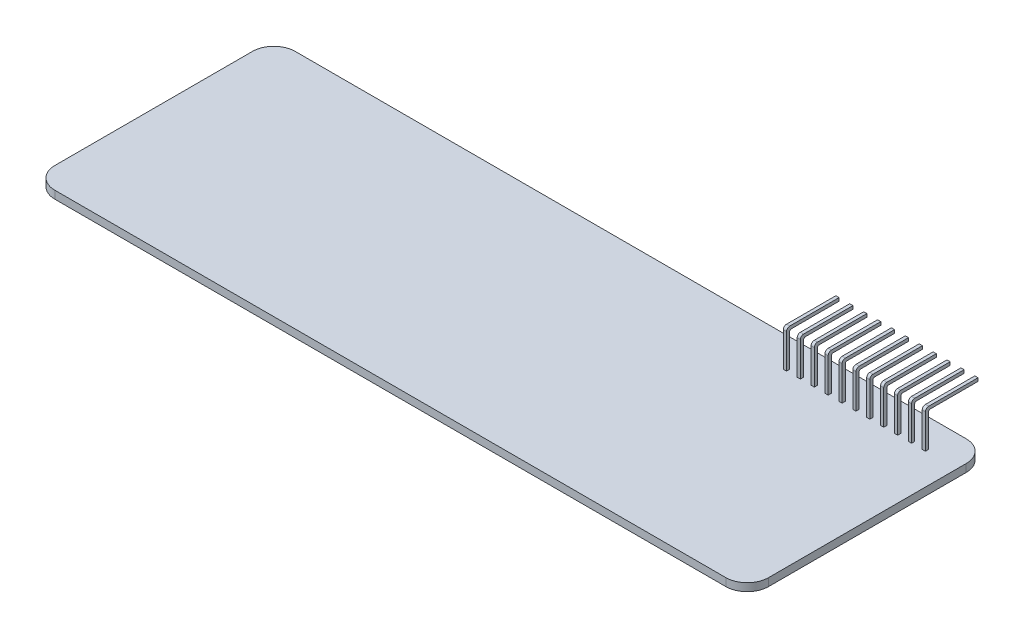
ISO-10303-21;
HEADER;
FILE_DESCRIPTION(('STEP AP214'),'2;1');
FILE_NAME('part.step','',(''),(''),'','','');
FILE_SCHEMA(('AUTOMOTIVE_DESIGN { 1 0 10303 214 1 1 1 1 }'));
ENDSEC;
DATA;
#1=APPLICATION_CONTEXT('core data for automotive mechanical design processes');
#2=APPLICATION_PROTOCOL_DEFINITION('international standard','automotive_design',2000,#1);
#3=PRODUCT_CONTEXT('',#1,'mechanical');
#4=PRODUCT('Part','Part','',(#3));
#5=PRODUCT_RELATED_PRODUCT_CATEGORY('part','',(#4));
#6=PRODUCT_DEFINITION_FORMATION('','',#4);
#7=PRODUCT_DEFINITION_CONTEXT('part definition',#1,'design');
#8=PRODUCT_DEFINITION('design','',#6,#7);
#9=PRODUCT_DEFINITION_SHAPE('','',#8);
#10=(LENGTH_UNIT() NAMED_UNIT(*) SI_UNIT(.MILLI.,.METRE.));
#11=(NAMED_UNIT(*) PLANE_ANGLE_UNIT() SI_UNIT($,.RADIAN.));
#12=(NAMED_UNIT(*) SI_UNIT($,.STERADIAN.) SOLID_ANGLE_UNIT());
#13=UNCERTAINTY_MEASURE_WITH_UNIT(LENGTH_MEASURE(1.E-05),#10,'distance_accuracy_value','');
#14=(GEOMETRIC_REPRESENTATION_CONTEXT(3) GLOBAL_UNCERTAINTY_ASSIGNED_CONTEXT((#13)) GLOBAL_UNIT_ASSIGNED_CONTEXT((#10,
#11,#12)) REPRESENTATION_CONTEXT('',''));
#15=CARTESIAN_POINT('',(0.,0.,0.));
#16=DIRECTION('',(0.,0.,1.));
#17=DIRECTION('',(1.,0.,0.));
#18=AXIS2_PLACEMENT_3D('',#15,#16,#17);
#19=CARTESIAN_POINT('',(16.5,-3.95999999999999,2.62139429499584));
#20=DIRECTION('',(0.,0.,1.));
#21=DIRECTION('',(0.,-1.,0.));
#22=AXIS2_PLACEMENT_3D('',#19,#20,#21);
#23=PLANE('',#22);
#24=DIRECTION('',(0.,-1.,0.));
#25=VECTOR('',#24,1.);
#26=CARTESIAN_POINT('',(17.2,-3.95999999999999,2.62139429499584));
#27=LINE('',#26,#25);
#28=CARTESIAN_POINT('',(17.2,-3.95999999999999,2.62139429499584));
#29=VERTEX_POINT('',#28);
#30=CARTESIAN_POINT('',(17.2,-7.01000000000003,2.62139429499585));
#31=VERTEX_POINT('',#30);
#32=EDGE_CURVE('E626',#29,#31,#27,.T.);
#33=ORIENTED_EDGE('',*,*,#32,.F.);
#34=DIRECTION('',(1.,0.,0.));
#35=VECTOR('',#34,1.);
#36=CARTESIAN_POINT('',(16.5,-3.95999999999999,2.62139429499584));
#37=LINE('',#36,#35);
#38=CARTESIAN_POINT('',(17.5,-3.95999999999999,2.62139429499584));
#39=VERTEX_POINT('',#38);
#40=EDGE_CURVE('E1118',#29,#39,#37,.T.);
#41=ORIENTED_EDGE('',*,*,#40,.T.);
#42=DIRECTION('',(0.,1.,0.));
#43=VECTOR('',#42,1.);
#44=CARTESIAN_POINT('',(17.5,-3.95999999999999,2.62139429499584));
#45=LINE('',#44,#43);
#46=CARTESIAN_POINT('',(17.5,-7.01000000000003,2.62139429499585));
#47=VERTEX_POINT('',#46);
#48=EDGE_CURVE('E651',#47,#39,#45,.T.);
#49=ORIENTED_EDGE('',*,*,#48,.F.);
#50=DIRECTION('',(-1.,0.,0.));
#51=VECTOR('',#50,1.);
#52=CARTESIAN_POINT('',(-33.4,-7.01000000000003,2.62139429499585));
#53=LINE('',#52,#51);
#54=EDGE_CURVE('E645',#47,#31,#53,.T.);
#55=ORIENTED_EDGE('',*,*,#54,.T.);
#56=EDGE_LOOP('',(#33,#41,#49,#55));
#57=FACE_BOUND('',#56,.T.);
#58=ADVANCED_FACE('F30',(#57),#23,.F.);
#59=CARTESIAN_POINT('',(16.5,-3.80999999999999,2.92139429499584));
#60=DIRECTION('',(0.,0.,-1.));
#61=DIRECTION('',(0.,1.,0.));
#62=AXIS2_PLACEMENT_3D('',#59,#60,#61);
#63=PLANE('',#62);
#64=DIRECTION('',(0.,1.,0.));
#65=VECTOR('',#64,1.);
#66=CARTESIAN_POINT('',(17.2,-3.80999999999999,2.92139429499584));
#67=LINE('',#66,#65);
#68=CARTESIAN_POINT('',(17.2,-7.01000000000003,2.92139429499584));
#69=VERTEX_POINT('',#68);
#70=CARTESIAN_POINT('',(17.2,-3.80999999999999,2.92139429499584));
#71=VERTEX_POINT('',#70);
#72=EDGE_CURVE('E637',#69,#71,#67,.T.);
#73=ORIENTED_EDGE('',*,*,#72,.F.);
#74=DIRECTION('',(1.,0.,0.));
#75=VECTOR('',#74,1.);
#76=CARTESIAN_POINT('',(-33.4,-7.01000000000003,2.92139429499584));
#77=LINE('',#76,#75);
#78=CARTESIAN_POINT('',(17.5,-7.01000000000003,2.92139429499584));
#79=VERTEX_POINT('',#78);
#80=EDGE_CURVE('E646',#69,#79,#77,.T.);
#81=ORIENTED_EDGE('',*,*,#80,.T.);
#82=DIRECTION('',(0.,-1.,0.));
#83=VECTOR('',#82,1.);
#84=CARTESIAN_POINT('',(17.5,-3.80999999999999,2.92139429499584));
#85=LINE('',#84,#83);
#86=CARTESIAN_POINT('',(17.5,-3.80999999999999,2.92139429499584));
#87=VERTEX_POINT('',#86);
#88=EDGE_CURVE('E1376',#87,#79,#85,.T.);
#89=ORIENTED_EDGE('',*,*,#88,.F.);
#90=DIRECTION('',(1.,0.,0.));
#91=VECTOR('',#90,1.);
#92=CARTESIAN_POINT('',(16.5,-3.80999999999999,2.92139429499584));
#93=LINE('',#92,#91);
#94=EDGE_CURVE('E1114',#71,#87,#93,.T.);
#95=ORIENTED_EDGE('',*,*,#94,.F.);
#96=EDGE_LOOP('',(#73,#81,#89,#95));
#97=FACE_BOUND('',#96,.T.);
#98=ADVANCED_FACE('F1420',(#97),#63,.F.);
#99=CARTESIAN_POINT('',(16.5,-3.95999999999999,2.47139429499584));
#100=DIRECTION('',(1.,0.,0.));
#101=DIRECTION('',(0.,1.,0.));
#102=AXIS2_PLACEMENT_3D('',#99,#100,#101);
#103=CYLINDRICAL_SURFACE('',#102,0.15);
#104=CARTESIAN_POINT('',(17.2,-3.95999999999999,2.47139429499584));
#105=DIRECTION('',(-1.,0.,0.));
#106=DIRECTION('',(0.,0.,1.));
#107=AXIS2_PLACEMENT_3D('',#104,#105,#106);
#108=CIRCLE('',#107,0.15);
#109=CARTESIAN_POINT('',(17.2,-3.80999999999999,2.47139429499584));
#110=VERTEX_POINT('',#109);
#111=EDGE_CURVE('E632',#110,#29,#108,.F.);
#112=ORIENTED_EDGE('',*,*,#111,.F.);
#113=DIRECTION('',(1.,0.,0.));
#114=VECTOR('',#113,1.);
#115=CARTESIAN_POINT('',(16.5,-3.80999999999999,2.47139429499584));
#116=LINE('',#115,#114);
#117=CARTESIAN_POINT('',(17.5,-3.80999999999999,2.47139429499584));
#118=VERTEX_POINT('',#117);
#119=EDGE_CURVE('E1106',#110,#118,#116,.T.);
#120=ORIENTED_EDGE('',*,*,#119,.T.);
#121=CARTESIAN_POINT('',(17.5,-3.95999999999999,2.47139429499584));
#122=DIRECTION('',(1.,0.,0.));
#123=DIRECTION('',(0.,0.,-1.));
#124=AXIS2_PLACEMENT_3D('',#121,#122,#123);
#125=CIRCLE('',#124,0.15);
#126=EDGE_CURVE('E1379',#39,#118,#125,.F.);
#127=ORIENTED_EDGE('',*,*,#126,.F.);
#128=ORIENTED_EDGE('',*,*,#40,.F.);
#129=EDGE_LOOP('',(#112,#120,#127,#128));
#130=FACE_BOUND('',#129,.T.);
#131=ADVANCED_FACE('F1423',(#130),#103,.F.);
#132=CARTESIAN_POINT('',(16.5,-3.80999999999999,2.62139429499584));
#133=DIRECTION('',(1.,0.,0.));
#134=DIRECTION('',(0.,1.,0.));
#135=AXIS2_PLACEMENT_3D('',#132,#133,#134);
#136=CYLINDRICAL_SURFACE('',#135,0.3);
#137=CARTESIAN_POINT('',(17.2,-3.80999999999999,2.62139429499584));
#138=DIRECTION('',(-1.,0.,0.));
#139=DIRECTION('',(0.,0.,1.));
#140=AXIS2_PLACEMENT_3D('',#137,#138,#139);
#141=CIRCLE('',#140,0.3);
#142=CARTESIAN_POINT('',(17.2,-3.50999999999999,2.62139429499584));
#143=VERTEX_POINT('',#142);
#144=EDGE_CURVE('E1394',#71,#143,#141,.T.);
#145=ORIENTED_EDGE('',*,*,#144,.F.);
#146=ORIENTED_EDGE('',*,*,#94,.T.);
#147=CARTESIAN_POINT('',(17.5,-3.80999999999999,2.62139429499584));
#148=DIRECTION('',(1.,0.,0.));
#149=DIRECTION('',(0.,0.,-1.));
#150=AXIS2_PLACEMENT_3D('',#147,#148,#149);
#151=CIRCLE('',#150,0.3);
#152=CARTESIAN_POINT('',(17.5,-3.50999999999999,2.62139429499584));
#153=VERTEX_POINT('',#152);
#154=EDGE_CURVE('E1381',#153,#87,#151,.T.);
#155=ORIENTED_EDGE('',*,*,#154,.F.);
#156=DIRECTION('',(1.,0.,0.));
#157=VECTOR('',#156,1.);
#158=CARTESIAN_POINT('',(16.5,-3.50999999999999,2.62139429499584));
#159=LINE('',#158,#157);
#160=EDGE_CURVE('E1110',#143,#153,#159,.T.);
#161=ORIENTED_EDGE('',*,*,#160,.F.);
#162=EDGE_LOOP('',(#145,#146,#155,#161));
#163=FACE_BOUND('',#162,.T.);
#164=ADVANCED_FACE('F1417',(#163),#136,.T.);
#165=CARTESIAN_POINT('',(16.5,-3.50999999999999,0.000100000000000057));
#166=DIRECTION('',(0.,-1.,0.));
#167=DIRECTION('',(1.,0.,0.));
#168=AXIS2_PLACEMENT_3D('',#165,#166,#167);
#169=PLANE('',#168);
#170=DIRECTION('',(0.,0.,-1.));
#171=VECTOR('',#170,1.);
#172=CARTESIAN_POINT('',(17.2,-3.50999999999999,0.000100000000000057));
#173=LINE('',#172,#171);
#174=CARTESIAN_POINT('',(17.2,-3.50999999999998,-1.9999));
#175=VERTEX_POINT('',#174);
#176=EDGE_CURVE('E1396',#143,#175,#173,.T.);
#177=ORIENTED_EDGE('',*,*,#176,.F.);
#178=ORIENTED_EDGE('',*,*,#160,.T.);
#179=DIRECTION('',(0.,0.,1.));
#180=VECTOR('',#179,1.);
#181=CARTESIAN_POINT('',(17.5,-3.50999999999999,0.000100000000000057));
#182=LINE('',#181,#180);
#183=CARTESIAN_POINT('',(17.5,-3.50999999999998,-1.9999));
#184=VERTEX_POINT('',#183);
#185=EDGE_CURVE('E1384',#184,#153,#182,.T.);
#186=ORIENTED_EDGE('',*,*,#185,.F.);
#187=DIRECTION('',(1.,0.,0.));
#188=VECTOR('',#187,1.);
#189=CARTESIAN_POINT('',(30.5,-3.50999999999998,-1.9999));
#190=LINE('',#189,#188);
#191=EDGE_CURVE('E1085',#175,#184,#190,.T.);
#192=ORIENTED_EDGE('',*,*,#191,.F.);
#193=EDGE_LOOP('',(#177,#178,#186,#192));
#194=FACE_BOUND('',#193,.T.);
#195=ADVANCED_FACE('F1410',(#194),#169,.F.);
#196=CARTESIAN_POINT('',(16.5,-3.80999999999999,2.47139429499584));
#197=DIRECTION('',(0.,1.,0.));
#198=DIRECTION('',(-1.,0.,0.));
#199=AXIS2_PLACEMENT_3D('',#196,#197,#198);
#200=PLANE('',#199);
#201=DIRECTION('',(0.,0.,1.));
#202=VECTOR('',#201,1.);
#203=CARTESIAN_POINT('',(17.2,-3.80999999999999,2.47139429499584));
#204=LINE('',#203,#202);
#205=CARTESIAN_POINT('',(17.2,-3.80999999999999,-1.9999));
#206=VERTEX_POINT('',#205);
#207=EDGE_CURVE('E1398',#206,#110,#204,.T.);
#208=ORIENTED_EDGE('',*,*,#207,.F.);
#209=DIRECTION('',(-1.,0.,0.));
#210=VECTOR('',#209,1.);
#211=CARTESIAN_POINT('',(30.5,-3.80999999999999,-1.9999));
#212=LINE('',#211,#210);
#213=CARTESIAN_POINT('',(17.5,-3.80999999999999,-1.9999));
#214=VERTEX_POINT('',#213);
#215=EDGE_CURVE('E1079',#214,#206,#212,.T.);
#216=ORIENTED_EDGE('',*,*,#215,.F.);
#217=DIRECTION('',(0.,0.,-1.));
#218=VECTOR('',#217,1.);
#219=CARTESIAN_POINT('',(17.5,-3.80999999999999,2.47139429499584));
#220=LINE('',#219,#218);
#221=EDGE_CURVE('E45',#118,#214,#220,.T.);
#222=ORIENTED_EDGE('',*,*,#221,.F.);
#223=ORIENTED_EDGE('',*,*,#119,.F.);
#224=EDGE_LOOP('',(#208,#216,#222,#223));
#225=FACE_BOUND('',#224,.T.);
#226=ADVANCED_FACE('F1426',(#225),#200,.F.);
#227=CARTESIAN_POINT('',(30.5,-3.80999999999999,-1.9999));
#228=DIRECTION('',(0.,0.,-1.));
#229=DIRECTION('',(-1.,0.,0.));
#230=AXIS2_PLACEMENT_3D('',#227,#228,#229);
#231=PLANE('',#230);
#232=ORIENTED_EDGE('',*,*,#215,.T.);
#233=DIRECTION('',(0.,1.,0.));
#234=VECTOR('',#233,1.);
#235=CARTESIAN_POINT('',(17.2,-3.80999999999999,-1.9999));
#236=LINE('',#235,#234);
#237=EDGE_CURVE('E647',#206,#175,#236,.T.);
#238=ORIENTED_EDGE('',*,*,#237,.T.);
#239=ORIENTED_EDGE('',*,*,#191,.T.);
#240=DIRECTION('',(0.,-1.,0.));
#241=VECTOR('',#240,1.);
#242=CARTESIAN_POINT('',(17.5,-3.80999999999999,-1.9999));
#243=LINE('',#242,#241);
#244=EDGE_CURVE('E1388',#184,#214,#243,.T.);
#245=ORIENTED_EDGE('',*,*,#244,.T.);
#246=EDGE_LOOP('',(#232,#238,#239,#245));
#247=FACE_BOUND('',#246,.T.);
#248=ADVANCED_FACE('F1404',(#247),#231,.T.);
#249=DIRECTION('',(0.,-1.,0.));
#250=VECTOR('',#249,1.);
#251=CARTESIAN_POINT('',(18.5,-3.95999999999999,2.62139429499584));
#252=LINE('',#251,#250);
#253=CARTESIAN_POINT('',(18.5,-3.95999999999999,2.62139429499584));
#254=VERTEX_POINT('',#253);
#255=CARTESIAN_POINT('',(18.5,-7.01000000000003,2.62139429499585));
#256=VERTEX_POINT('',#255);
#257=EDGE_CURVE('E733',#254,#256,#252,.T.);
#258=ORIENTED_EDGE('',*,*,#257,.F.);
#259=CARTESIAN_POINT('',(18.8,-3.95999999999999,2.62139429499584));
#260=VERTEX_POINT('',#259);
#261=EDGE_CURVE('E1121',#254,#260,#37,.T.);
#262=ORIENTED_EDGE('',*,*,#261,.T.);
#263=DIRECTION('',(0.,1.,0.));
#264=VECTOR('',#263,1.);
#265=CARTESIAN_POINT('',(18.8,-3.95999999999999,2.62139429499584));
#266=LINE('',#265,#264);
#267=CARTESIAN_POINT('',(18.8,-7.01000000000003,2.62139429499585));
#268=VERTEX_POINT('',#267);
#269=EDGE_CURVE('E749',#268,#260,#266,.T.);
#270=ORIENTED_EDGE('',*,*,#269,.F.);
#271=EDGE_CURVE('E652',#268,#256,#53,.T.);
#272=ORIENTED_EDGE('',*,*,#271,.T.);
#273=EDGE_LOOP('',(#258,#262,#270,#272));
#274=FACE_BOUND('',#273,.T.);
#275=ADVANCED_FACE('F1240',(#274),#23,.F.);
#276=DIRECTION('',(0.,1.,0.));
#277=VECTOR('',#276,1.);
#278=CARTESIAN_POINT('',(18.5,-3.80999999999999,2.92139429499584));
#279=LINE('',#278,#277);
#280=CARTESIAN_POINT('',(18.5,-7.01000000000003,2.92139429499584));
#281=VERTEX_POINT('',#280);
#282=CARTESIAN_POINT('',(18.5,-3.80999999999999,2.92139429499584));
#283=VERTEX_POINT('',#282);
#284=EDGE_CURVE('E1231',#281,#283,#279,.T.);
#285=ORIENTED_EDGE('',*,*,#284,.F.);
#286=CARTESIAN_POINT('',(18.8,-7.01000000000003,2.92139429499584));
#287=VERTEX_POINT('',#286);
#288=EDGE_CURVE('E657',#281,#287,#77,.T.);
#289=ORIENTED_EDGE('',*,*,#288,.T.);
#290=DIRECTION('',(0.,-1.,0.));
#291=VECTOR('',#290,1.);
#292=CARTESIAN_POINT('',(18.8,-3.80999999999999,2.92139429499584));
#293=LINE('',#292,#291);
#294=CARTESIAN_POINT('',(18.8,-3.80999999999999,2.92139429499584));
#295=VERTEX_POINT('',#294);
#296=EDGE_CURVE('E746',#295,#287,#293,.T.);
#297=ORIENTED_EDGE('',*,*,#296,.F.);
#298=EDGE_CURVE('E1117',#283,#295,#93,.T.);
#299=ORIENTED_EDGE('',*,*,#298,.F.);
#300=EDGE_LOOP('',(#285,#289,#297,#299));
#301=FACE_BOUND('',#300,.T.);
#302=ADVANCED_FACE('F1229',(#301),#63,.F.);
#303=CARTESIAN_POINT('',(18.5,-3.95999999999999,2.47139429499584));
#304=DIRECTION('',(-1.,0.,0.));
#305=DIRECTION('',(0.,0.,1.));
#306=AXIS2_PLACEMENT_3D('',#303,#304,#305);
#307=CIRCLE('',#306,0.15);
#308=CARTESIAN_POINT('',(18.5,-3.80999999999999,2.47139429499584));
#309=VERTEX_POINT('',#308);
#310=EDGE_CURVE('E1247',#309,#254,#307,.F.);
#311=ORIENTED_EDGE('',*,*,#310,.F.);
#312=CARTESIAN_POINT('',(18.8,-3.80999999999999,2.47139429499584));
#313=VERTEX_POINT('',#312);
#314=EDGE_CURVE('E1109',#309,#313,#116,.T.);
#315=ORIENTED_EDGE('',*,*,#314,.T.);
#316=CARTESIAN_POINT('',(18.8,-3.95999999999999,2.47139429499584));
#317=DIRECTION('',(1.,0.,0.));
#318=DIRECTION('',(0.,0.,-1.));
#319=AXIS2_PLACEMENT_3D('',#316,#317,#318);
#320=CIRCLE('',#319,0.15);
#321=EDGE_CURVE('E744',#260,#313,#320,.F.);
#322=ORIENTED_EDGE('',*,*,#321,.F.);
#323=ORIENTED_EDGE('',*,*,#261,.F.);
#324=EDGE_LOOP('',(#311,#315,#322,#323));
#325=FACE_BOUND('',#324,.T.);
#326=ADVANCED_FACE('F1245',(#325),#103,.F.);
#327=CARTESIAN_POINT('',(18.5,-3.80999999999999,2.62139429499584));
#328=DIRECTION('',(-1.,0.,0.));
#329=DIRECTION('',(0.,0.,1.));
#330=AXIS2_PLACEMENT_3D('',#327,#328,#329);
#331=CIRCLE('',#330,0.3);
#332=CARTESIAN_POINT('',(18.5,-3.50999999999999,2.62139429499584));
#333=VERTEX_POINT('',#332);
#334=EDGE_CURVE('E1358',#283,#333,#331,.T.);
#335=ORIENTED_EDGE('',*,*,#334,.F.);
#336=ORIENTED_EDGE('',*,*,#298,.T.);
#337=CARTESIAN_POINT('',(18.8,-3.80999999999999,2.62139429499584));
#338=DIRECTION('',(1.,0.,0.));
#339=DIRECTION('',(0.,0.,-1.));
#340=AXIS2_PLACEMENT_3D('',#337,#338,#339);
#341=CIRCLE('',#340,0.3);
#342=CARTESIAN_POINT('',(18.8,-3.50999999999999,2.62139429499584));
#343=VERTEX_POINT('',#342);
#344=EDGE_CURVE('E741',#343,#295,#341,.T.);
#345=ORIENTED_EDGE('',*,*,#344,.F.);
#346=EDGE_CURVE('E1113',#333,#343,#159,.T.);
#347=ORIENTED_EDGE('',*,*,#346,.F.);
#348=EDGE_LOOP('',(#335,#336,#345,#347));
#349=FACE_BOUND('',#348,.T.);
#350=ADVANCED_FACE('F1356',(#349),#136,.T.);
#351=DIRECTION('',(0.,0.,-1.));
#352=VECTOR('',#351,1.);
#353=CARTESIAN_POINT('',(18.5,-3.50999999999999,0.000100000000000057));
#354=LINE('',#353,#352);
#355=CARTESIAN_POINT('',(18.5,-3.50999999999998,-1.9999));
#356=VERTEX_POINT('',#355);
#357=EDGE_CURVE('E1361',#333,#356,#354,.T.);
#358=ORIENTED_EDGE('',*,*,#357,.F.);
#359=ORIENTED_EDGE('',*,*,#346,.T.);
#360=DIRECTION('',(0.,0.,1.));
#361=VECTOR('',#360,1.);
#362=CARTESIAN_POINT('',(18.8,-3.50999999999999,0.000100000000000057));
#363=LINE('',#362,#361);
#364=CARTESIAN_POINT('',(18.8,-3.50999999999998,-1.9999));
#365=VERTEX_POINT('',#364);
#366=EDGE_CURVE('E738',#365,#343,#363,.T.);
#367=ORIENTED_EDGE('',*,*,#366,.F.);
#368=EDGE_CURVE('E1088',#356,#365,#190,.T.);
#369=ORIENTED_EDGE('',*,*,#368,.F.);
#370=EDGE_LOOP('',(#358,#359,#367,#369));
#371=FACE_BOUND('',#370,.T.);
#372=ADVANCED_FACE('F1595',(#371),#169,.F.);
#373=DIRECTION('',(0.,0.,1.));
#374=VECTOR('',#373,1.);
#375=CARTESIAN_POINT('',(18.5,-3.80999999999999,2.47139429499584));
#376=LINE('',#375,#374);
#377=CARTESIAN_POINT('',(18.5,-3.80999999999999,-1.9999));
#378=VERTEX_POINT('',#377);
#379=EDGE_CURVE('E1364',#378,#309,#376,.T.);
#380=ORIENTED_EDGE('',*,*,#379,.F.);
#381=CARTESIAN_POINT('',(18.8,-3.80999999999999,-1.9999));
#382=VERTEX_POINT('',#381);
#383=EDGE_CURVE('E1427',#382,#378,#212,.T.);
#384=ORIENTED_EDGE('',*,*,#383,.F.);
#385=DIRECTION('',(0.,0.,-1.));
#386=VECTOR('',#385,1.);
#387=CARTESIAN_POINT('',(18.8,-3.80999999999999,2.47139429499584));
#388=LINE('',#387,#386);
#389=EDGE_CURVE('E53',#313,#382,#388,.T.);
#390=ORIENTED_EDGE('',*,*,#389,.F.);
#391=ORIENTED_EDGE('',*,*,#314,.F.);
#392=EDGE_LOOP('',(#380,#384,#390,#391));
#393=FACE_BOUND('',#392,.T.);
#394=ADVANCED_FACE('F1591',(#393),#200,.F.);
#395=ORIENTED_EDGE('',*,*,#383,.T.);
#396=DIRECTION('',(0.,1.,0.));
#397=VECTOR('',#396,1.);
#398=CARTESIAN_POINT('',(18.5,-3.80999999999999,-1.9999));
#399=LINE('',#398,#397);
#400=EDGE_CURVE('E1370',#378,#356,#399,.T.);
#401=ORIENTED_EDGE('',*,*,#400,.T.);
#402=ORIENTED_EDGE('',*,*,#368,.T.);
#403=DIRECTION('',(0.,-1.,0.));
#404=VECTOR('',#403,1.);
#405=CARTESIAN_POINT('',(18.8,-3.80999999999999,-1.9999));
#406=LINE('',#405,#404);
#407=EDGE_CURVE('E728',#365,#382,#406,.T.);
#408=ORIENTED_EDGE('',*,*,#407,.T.);
#409=EDGE_LOOP('',(#395,#401,#402,#408));
#410=FACE_BOUND('',#409,.T.);
#411=ADVANCED_FACE('F1586',(#410),#231,.T.);
#412=DIRECTION('',(0.,-1.,0.));
#413=VECTOR('',#412,1.);
#414=CARTESIAN_POINT('',(19.8,-3.95999999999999,2.62139429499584));
#415=LINE('',#414,#413);
#416=CARTESIAN_POINT('',(19.8,-3.95999999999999,2.62139429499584));
#417=VERTEX_POINT('',#416);
#418=CARTESIAN_POINT('',(19.8,-7.01000000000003,2.62139429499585));
#419=VERTEX_POINT('',#418);
#420=EDGE_CURVE('E714',#417,#419,#415,.T.);
#421=ORIENTED_EDGE('',*,*,#420,.F.);
#422=CARTESIAN_POINT('',(20.1,-3.95999999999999,2.62139429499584));
#423=VERTEX_POINT('',#422);
#424=EDGE_CURVE('E1483',#417,#423,#37,.T.);
#425=ORIENTED_EDGE('',*,*,#424,.T.);
#426=DIRECTION('',(0.,1.,0.));
#427=VECTOR('',#426,1.);
#428=CARTESIAN_POINT('',(20.1,-3.95999999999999,2.62139429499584));
#429=LINE('',#428,#427);
#430=CARTESIAN_POINT('',(20.1,-7.01000000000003,2.62139429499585));
#431=VERTEX_POINT('',#430);
#432=EDGE_CURVE('E717',#431,#423,#429,.T.);
#433=ORIENTED_EDGE('',*,*,#432,.F.);
#434=EDGE_CURVE('E656',#431,#419,#53,.T.);
#435=ORIENTED_EDGE('',*,*,#434,.T.);
#436=EDGE_LOOP('',(#421,#425,#433,#435));
#437=FACE_BOUND('',#436,.T.);
#438=ADVANCED_FACE('F713',(#437),#23,.F.);
#439=DIRECTION('',(0.,1.,0.));
#440=VECTOR('',#439,1.);
#441=CARTESIAN_POINT('',(19.8,-3.80999999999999,2.92139429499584));
#442=LINE('',#441,#440);
#443=CARTESIAN_POINT('',(19.8,-7.01000000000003,2.92139429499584));
#444=VERTEX_POINT('',#443);
#445=CARTESIAN_POINT('',(19.8,-3.80999999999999,2.92139429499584));
#446=VERTEX_POINT('',#445);
#447=EDGE_CURVE('E763',#444,#446,#442,.T.);
#448=ORIENTED_EDGE('',*,*,#447,.F.);
#449=CARTESIAN_POINT('',(20.1,-7.01000000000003,2.92139429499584));
#450=VERTEX_POINT('',#449);
#451=EDGE_CURVE('E725',#444,#450,#77,.T.);
#452=ORIENTED_EDGE('',*,*,#451,.T.);
#453=DIRECTION('',(0.,-1.,0.));
#454=VECTOR('',#453,1.);
#455=CARTESIAN_POINT('',(20.1,-3.80999999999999,2.92139429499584));
#456=LINE('',#455,#454);
#457=CARTESIAN_POINT('',(20.1,-3.80999999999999,2.92139429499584));
#458=VERTEX_POINT('',#457);
#459=EDGE_CURVE('E783',#458,#450,#456,.T.);
#460=ORIENTED_EDGE('',*,*,#459,.F.);
#461=EDGE_CURVE('E1345',#446,#458,#93,.T.);
#462=ORIENTED_EDGE('',*,*,#461,.F.);
#463=EDGE_LOOP('',(#448,#452,#460,#462));
#464=FACE_BOUND('',#463,.T.);
#465=ADVANCED_FACE('F1491',(#464),#63,.F.);
#466=CARTESIAN_POINT('',(19.8,-3.95999999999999,2.47139429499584));
#467=DIRECTION('',(-1.,0.,0.));
#468=DIRECTION('',(0.,0.,1.));
#469=AXIS2_PLACEMENT_3D('',#466,#467,#468);
#470=CIRCLE('',#469,0.15);
#471=CARTESIAN_POINT('',(19.8,-3.80999999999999,2.47139429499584));
#472=VERTEX_POINT('',#471);
#473=EDGE_CURVE('E761',#472,#417,#470,.F.);
#474=ORIENTED_EDGE('',*,*,#473,.F.);
#475=CARTESIAN_POINT('',(20.1,-3.80999999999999,2.47139429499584));
#476=VERTEX_POINT('',#475);
#477=EDGE_CURVE('E1250',#472,#476,#116,.T.);
#478=ORIENTED_EDGE('',*,*,#477,.T.);
#479=CARTESIAN_POINT('',(20.1,-3.95999999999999,2.47139429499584));
#480=DIRECTION('',(1.,0.,0.));
#481=DIRECTION('',(0.,0.,-1.));
#482=AXIS2_PLACEMENT_3D('',#479,#480,#481);
#483=CIRCLE('',#482,0.15);
#484=EDGE_CURVE('E780',#423,#476,#483,.F.);
#485=ORIENTED_EDGE('',*,*,#484,.F.);
#486=ORIENTED_EDGE('',*,*,#424,.F.);
#487=EDGE_LOOP('',(#474,#478,#485,#486));
#488=FACE_BOUND('',#487,.T.);
#489=ADVANCED_FACE('F1488',(#488),#103,.F.);
#490=CARTESIAN_POINT('',(19.8,-3.80999999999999,2.62139429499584));
#491=DIRECTION('',(-1.,0.,0.));
#492=DIRECTION('',(0.,0.,1.));
#493=AXIS2_PLACEMENT_3D('',#490,#491,#492);
#494=CIRCLE('',#493,0.3);
#495=CARTESIAN_POINT('',(19.8,-3.50999999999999,2.62139429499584));
#496=VERTEX_POINT('',#495);
#497=EDGE_CURVE('E759',#446,#496,#494,.T.);
#498=ORIENTED_EDGE('',*,*,#497,.F.);
#499=ORIENTED_EDGE('',*,*,#461,.T.);
#500=CARTESIAN_POINT('',(20.1,-3.80999999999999,2.62139429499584));
#501=DIRECTION('',(1.,0.,0.));
#502=DIRECTION('',(0.,0.,-1.));
#503=AXIS2_PLACEMENT_3D('',#500,#501,#502);
#504=CIRCLE('',#503,0.3);
#505=CARTESIAN_POINT('',(20.1,-3.50999999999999,2.62139429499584));
#506=VERTEX_POINT('',#505);
#507=EDGE_CURVE('E777',#506,#458,#504,.T.);
#508=ORIENTED_EDGE('',*,*,#507,.F.);
#509=EDGE_CURVE('E1738',#496,#506,#159,.T.);
#510=ORIENTED_EDGE('',*,*,#509,.F.);
#511=EDGE_LOOP('',(#498,#499,#508,#510));
#512=FACE_BOUND('',#511,.T.);
#513=ADVANCED_FACE('F1490',(#512),#136,.T.);
#514=DIRECTION('',(0.,0.,-1.));
#515=VECTOR('',#514,1.);
#516=CARTESIAN_POINT('',(19.8,-3.50999999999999,0.000100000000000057));
#517=LINE('',#516,#515);
#518=CARTESIAN_POINT('',(19.8,-3.50999999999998,-1.9999));
#519=VERTEX_POINT('',#518);
#520=EDGE_CURVE('E757',#496,#519,#517,.T.);
#521=ORIENTED_EDGE('',*,*,#520,.F.);
#522=ORIENTED_EDGE('',*,*,#509,.T.);
#523=DIRECTION('',(0.,0.,1.));
#524=VECTOR('',#523,1.);
#525=CARTESIAN_POINT('',(20.1,-3.50999999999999,0.000100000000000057));
#526=LINE('',#525,#524);
#527=CARTESIAN_POINT('',(20.1,-3.50999999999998,-1.9999));
#528=VERTEX_POINT('',#527);
#529=EDGE_CURVE('E774',#528,#506,#526,.T.);
#530=ORIENTED_EDGE('',*,*,#529,.F.);
#531=EDGE_CURVE('E1696',#519,#528,#190,.T.);
#532=ORIENTED_EDGE('',*,*,#531,.F.);
#533=EDGE_LOOP('',(#521,#522,#530,#532));
#534=FACE_BOUND('',#533,.T.);
#535=ADVANCED_FACE('F1498',(#534),#169,.F.);
#536=DIRECTION('',(0.,0.,1.));
#537=VECTOR('',#536,1.);
#538=CARTESIAN_POINT('',(19.8,-3.80999999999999,2.47139429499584));
#539=LINE('',#538,#537);
#540=CARTESIAN_POINT('',(19.8,-3.80999999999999,-1.9999));
#541=VERTEX_POINT('',#540);
#542=EDGE_CURVE('E755',#541,#472,#539,.T.);
#543=ORIENTED_EDGE('',*,*,#542,.F.);
#544=CARTESIAN_POINT('',(20.1,-3.80999999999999,-1.9999));
#545=VERTEX_POINT('',#544);
#546=EDGE_CURVE('E1428',#545,#541,#212,.T.);
#547=ORIENTED_EDGE('',*,*,#546,.F.);
#548=DIRECTION('',(0.,0.,-1.));
#549=VECTOR('',#548,1.);
#550=CARTESIAN_POINT('',(20.1,-3.80999999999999,2.47139429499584));
#551=LINE('',#550,#549);
#552=EDGE_CURVE('E772',#476,#545,#551,.T.);
#553=ORIENTED_EDGE('',*,*,#552,.F.);
#554=ORIENTED_EDGE('',*,*,#477,.F.);
#555=EDGE_LOOP('',(#543,#547,#553,#554));
#556=FACE_BOUND('',#555,.T.);
#557=ADVANCED_FACE('F1585',(#556),#200,.F.);
#558=ORIENTED_EDGE('',*,*,#546,.T.);
#559=DIRECTION('',(0.,1.,0.));
#560=VECTOR('',#559,1.);
#561=CARTESIAN_POINT('',(19.8,-3.80999999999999,-1.9999));
#562=LINE('',#561,#560);
#563=EDGE_CURVE('E752',#541,#519,#562,.T.);
#564=ORIENTED_EDGE('',*,*,#563,.T.);
#565=ORIENTED_EDGE('',*,*,#531,.T.);
#566=DIRECTION('',(0.,-1.,0.));
#567=VECTOR('',#566,1.);
#568=CARTESIAN_POINT('',(20.1,-3.80999999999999,-1.9999));
#569=LINE('',#568,#567);
#570=EDGE_CURVE('E769',#528,#545,#569,.T.);
#571=ORIENTED_EDGE('',*,*,#570,.T.);
#572=EDGE_LOOP('',(#558,#564,#565,#571));
#573=FACE_BOUND('',#572,.T.);
#574=ADVANCED_FACE('F1579',(#573),#231,.T.);
#575=DIRECTION('',(0.,-1.,0.));
#576=VECTOR('',#575,1.);
#577=CARTESIAN_POINT('',(21.1,-3.95999999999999,2.62139429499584));
#578=LINE('',#577,#576);
#579=CARTESIAN_POINT('',(21.1,-3.95999999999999,2.62139429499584));
#580=VERTEX_POINT('',#579);
#581=CARTESIAN_POINT('',(21.1,-7.01000000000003,2.62139429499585));
#582=VERTEX_POINT('',#581);
#583=EDGE_CURVE('E800',#580,#582,#578,.T.);
#584=ORIENTED_EDGE('',*,*,#583,.F.);
#585=CARTESIAN_POINT('',(21.4,-3.95999999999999,2.62139429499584));
#586=VERTEX_POINT('',#585);
#587=EDGE_CURVE('E1481',#580,#586,#37,.T.);
#588=ORIENTED_EDGE('',*,*,#587,.T.);
#589=DIRECTION('',(0.,1.,0.));
#590=VECTOR('',#589,1.);
#591=CARTESIAN_POINT('',(21.4,-3.95999999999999,2.62139429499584));
#592=LINE('',#591,#590);
#593=CARTESIAN_POINT('',(21.4,-7.01000000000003,2.62139429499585));
#594=VERTEX_POINT('',#593);
#595=EDGE_CURVE('E824',#594,#586,#592,.T.);
#596=ORIENTED_EDGE('',*,*,#595,.F.);
#597=EDGE_CURVE('E698',#594,#582,#53,.T.);
#598=ORIENTED_EDGE('',*,*,#597,.T.);
#599=EDGE_LOOP('',(#584,#588,#596,#598));
#600=FACE_BOUND('',#599,.T.);
#601=ADVANCED_FACE('F1573',(#600),#23,.F.);
#602=DIRECTION('',(0.,1.,0.));
#603=VECTOR('',#602,1.);
#604=CARTESIAN_POINT('',(21.1,-3.80999999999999,2.92139429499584));
#605=LINE('',#604,#603);
#606=CARTESIAN_POINT('',(21.1,-7.01000000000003,2.92139429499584));
#607=VERTEX_POINT('',#606);
#608=CARTESIAN_POINT('',(21.1,-3.80999999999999,2.92139429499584));
#609=VERTEX_POINT('',#608);
#610=EDGE_CURVE('E798',#607,#609,#605,.T.);
#611=ORIENTED_EDGE('',*,*,#610,.F.);
#612=CARTESIAN_POINT('',(21.4,-7.01000000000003,2.92139429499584));
#613=VERTEX_POINT('',#612);
#614=EDGE_CURVE('E1214',#607,#613,#77,.T.);
#615=ORIENTED_EDGE('',*,*,#614,.T.);
#616=DIRECTION('',(0.,-1.,0.));
#617=VECTOR('',#616,1.);
#618=CARTESIAN_POINT('',(21.4,-3.80999999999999,2.92139429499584));
#619=LINE('',#618,#617);
#620=CARTESIAN_POINT('',(21.4,-3.80999999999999,2.92139429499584));
#621=VERTEX_POINT('',#620);
#622=EDGE_CURVE('E821',#621,#613,#619,.T.);
#623=ORIENTED_EDGE('',*,*,#622,.F.);
#624=EDGE_CURVE('E1340',#609,#621,#93,.T.);
#625=ORIENTED_EDGE('',*,*,#624,.F.);
#626=EDGE_LOOP('',(#611,#615,#623,#625));
#627=FACE_BOUND('',#626,.T.);
#628=ADVANCED_FACE('F1502',(#627),#63,.F.);
#629=CARTESIAN_POINT('',(21.1,-3.95999999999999,2.47139429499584));
#630=DIRECTION('',(-1.,0.,0.));
#631=DIRECTION('',(0.,0.,1.));
#632=AXIS2_PLACEMENT_3D('',#629,#630,#631);
#633=CIRCLE('',#632,0.15);
#634=CARTESIAN_POINT('',(21.1,-3.80999999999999,2.47139429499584));
#635=VERTEX_POINT('',#634);
#636=EDGE_CURVE('E796',#635,#580,#633,.F.);
#637=ORIENTED_EDGE('',*,*,#636,.F.);
#638=CARTESIAN_POINT('',(21.4,-3.80999999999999,2.47139429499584));
#639=VERTEX_POINT('',#638);
#640=EDGE_CURVE('E1251',#635,#639,#116,.T.);
#641=ORIENTED_EDGE('',*,*,#640,.T.);
#642=CARTESIAN_POINT('',(21.4,-3.95999999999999,2.47139429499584));
#643=DIRECTION('',(1.,0.,0.));
#644=DIRECTION('',(0.,0.,-1.));
#645=AXIS2_PLACEMENT_3D('',#642,#643,#644);
#646=CIRCLE('',#645,0.15);
#647=EDGE_CURVE('E818',#586,#639,#646,.F.);
#648=ORIENTED_EDGE('',*,*,#647,.F.);
#649=ORIENTED_EDGE('',*,*,#587,.F.);
#650=EDGE_LOOP('',(#637,#641,#648,#649));
#651=FACE_BOUND('',#650,.T.);
#652=ADVANCED_FACE('F1493',(#651),#103,.F.);
#653=CARTESIAN_POINT('',(21.1,-3.80999999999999,2.62139429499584));
#654=DIRECTION('',(-1.,0.,0.));
#655=DIRECTION('',(0.,0.,1.));
#656=AXIS2_PLACEMENT_3D('',#653,#654,#655);
#657=CIRCLE('',#656,0.3);
#658=CARTESIAN_POINT('',(21.1,-3.50999999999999,2.62139429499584));
#659=VERTEX_POINT('',#658);
#660=EDGE_CURVE('E794',#609,#659,#657,.T.);
#661=ORIENTED_EDGE('',*,*,#660,.F.);
#662=ORIENTED_EDGE('',*,*,#624,.T.);
#663=CARTESIAN_POINT('',(21.4,-3.80999999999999,2.62139429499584));
#664=DIRECTION('',(1.,0.,0.));
#665=DIRECTION('',(0.,0.,-1.));
#666=AXIS2_PLACEMENT_3D('',#663,#664,#665);
#667=CIRCLE('',#666,0.3);
#668=CARTESIAN_POINT('',(21.4,-3.50999999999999,2.62139429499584));
#669=VERTEX_POINT('',#668);
#670=EDGE_CURVE('E815',#669,#621,#667,.T.);
#671=ORIENTED_EDGE('',*,*,#670,.F.);
#672=EDGE_CURVE('E1681',#659,#669,#159,.T.);
#673=ORIENTED_EDGE('',*,*,#672,.F.);
#674=EDGE_LOOP('',(#661,#662,#671,#673));
#675=FACE_BOUND('',#674,.T.);
#676=ADVANCED_FACE('F1500',(#675),#136,.T.);
#677=DIRECTION('',(0.,0.,-1.));
#678=VECTOR('',#677,1.);
#679=CARTESIAN_POINT('',(21.1,-3.50999999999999,0.000100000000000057));
#680=LINE('',#679,#678);
#681=CARTESIAN_POINT('',(21.1,-3.50999999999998,-1.9999));
#682=VERTEX_POINT('',#681);
#683=EDGE_CURVE('E792',#659,#682,#680,.T.);
#684=ORIENTED_EDGE('',*,*,#683,.F.);
#685=ORIENTED_EDGE('',*,*,#672,.T.);
#686=DIRECTION('',(0.,0.,1.));
#687=VECTOR('',#686,1.);
#688=CARTESIAN_POINT('',(21.4,-3.50999999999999,0.000100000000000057));
#689=LINE('',#688,#687);
#690=CARTESIAN_POINT('',(21.4,-3.50999999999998,-1.9999));
#691=VERTEX_POINT('',#690);
#692=EDGE_CURVE('E812',#691,#669,#689,.T.);
#693=ORIENTED_EDGE('',*,*,#692,.F.);
#694=EDGE_CURVE('E1694',#682,#691,#190,.T.);
#695=ORIENTED_EDGE('',*,*,#694,.F.);
#696=EDGE_LOOP('',(#684,#685,#693,#695));
#697=FACE_BOUND('',#696,.T.);
#698=ADVANCED_FACE('F1674',(#697),#169,.F.);
#699=DIRECTION('',(0.,0.,1.));
#700=VECTOR('',#699,1.);
#701=CARTESIAN_POINT('',(21.1,-3.80999999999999,2.47139429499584));
#702=LINE('',#701,#700);
#703=CARTESIAN_POINT('',(21.1,-3.80999999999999,-1.9999));
#704=VERTEX_POINT('',#703);
#705=EDGE_CURVE('E790',#704,#635,#702,.T.);
#706=ORIENTED_EDGE('',*,*,#705,.F.);
#707=CARTESIAN_POINT('',(21.4,-3.80999999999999,-1.9999));
#708=VERTEX_POINT('',#707);
#709=EDGE_CURVE('E1431',#708,#704,#212,.T.);
#710=ORIENTED_EDGE('',*,*,#709,.F.);
#711=DIRECTION('',(0.,0.,-1.));
#712=VECTOR('',#711,1.);
#713=CARTESIAN_POINT('',(21.4,-3.80999999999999,2.47139429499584));
#714=LINE('',#713,#712);
#715=EDGE_CURVE('E810',#639,#708,#714,.T.);
#716=ORIENTED_EDGE('',*,*,#715,.F.);
#717=ORIENTED_EDGE('',*,*,#640,.F.);
#718=EDGE_LOOP('',(#706,#710,#716,#717));
#719=FACE_BOUND('',#718,.T.);
#720=ADVANCED_FACE('F1578',(#719),#200,.F.);
#721=ORIENTED_EDGE('',*,*,#709,.T.);
#722=DIRECTION('',(0.,1.,0.));
#723=VECTOR('',#722,1.);
#724=CARTESIAN_POINT('',(21.1,-3.80999999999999,-1.9999));
#725=LINE('',#724,#723);
#726=EDGE_CURVE('E787',#704,#682,#725,.T.);
#727=ORIENTED_EDGE('',*,*,#726,.T.);
#728=ORIENTED_EDGE('',*,*,#694,.T.);
#729=DIRECTION('',(0.,-1.,0.));
#730=VECTOR('',#729,1.);
#731=CARTESIAN_POINT('',(21.4,-3.80999999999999,-1.9999));
#732=LINE('',#731,#730);
#733=EDGE_CURVE('E807',#691,#708,#732,.T.);
#734=ORIENTED_EDGE('',*,*,#733,.T.);
#735=EDGE_LOOP('',(#721,#727,#728,#734));
#736=FACE_BOUND('',#735,.T.);
#737=ADVANCED_FACE('F1571',(#736),#231,.T.);
#738=DIRECTION('',(0.,-1.,0.));
#739=VECTOR('',#738,1.);
#740=CARTESIAN_POINT('',(22.4,-3.95999999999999,2.62139429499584));
#741=LINE('',#740,#739);
#742=CARTESIAN_POINT('',(22.4,-3.95999999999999,2.62139429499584));
#743=VERTEX_POINT('',#742);
#744=CARTESIAN_POINT('',(22.4,-7.01000000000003,2.62139429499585));
#745=VERTEX_POINT('',#744);
#746=EDGE_CURVE('E840',#743,#745,#741,.T.);
#747=ORIENTED_EDGE('',*,*,#746,.F.);
#748=CARTESIAN_POINT('',(22.7,-3.95999999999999,2.62139429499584));
#749=VERTEX_POINT('',#748);
#750=EDGE_CURVE('E1479',#743,#749,#37,.T.);
#751=ORIENTED_EDGE('',*,*,#750,.T.);
#752=DIRECTION('',(0.,1.,0.));
#753=VECTOR('',#752,1.);
#754=CARTESIAN_POINT('',(22.7,-3.95999999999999,2.62139429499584));
#755=LINE('',#754,#753);
#756=CARTESIAN_POINT('',(22.7,-7.01000000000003,2.62139429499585));
#757=VERTEX_POINT('',#756);
#758=EDGE_CURVE('E864',#757,#749,#755,.T.);
#759=ORIENTED_EDGE('',*,*,#758,.F.);
#760=EDGE_CURVE('E692',#757,#745,#53,.T.);
#761=ORIENTED_EDGE('',*,*,#760,.T.);
#762=EDGE_LOOP('',(#747,#751,#759,#761));
#763=FACE_BOUND('',#762,.T.);
#764=ADVANCED_FACE('F1563',(#763),#23,.F.);
#765=DIRECTION('',(0.,1.,0.));
#766=VECTOR('',#765,1.);
#767=CARTESIAN_POINT('',(22.4,-3.80999999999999,2.92139429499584));
#768=LINE('',#767,#766);
#769=CARTESIAN_POINT('',(22.4,-7.01000000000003,2.92139429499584));
#770=VERTEX_POINT('',#769);
#771=CARTESIAN_POINT('',(22.4,-3.80999999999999,2.92139429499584));
#772=VERTEX_POINT('',#771);
#773=EDGE_CURVE('E838',#770,#772,#768,.T.);
#774=ORIENTED_EDGE('',*,*,#773,.F.);
#775=CARTESIAN_POINT('',(22.7,-7.01000000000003,2.92139429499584));
#776=VERTEX_POINT('',#775);
#777=EDGE_CURVE('E1209',#770,#776,#77,.T.);
#778=ORIENTED_EDGE('',*,*,#777,.T.);
#779=DIRECTION('',(0.,-1.,0.));
#780=VECTOR('',#779,1.);
#781=CARTESIAN_POINT('',(22.7,-3.80999999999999,2.92139429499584));
#782=LINE('',#781,#780);
#783=CARTESIAN_POINT('',(22.7,-3.80999999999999,2.92139429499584));
#784=VERTEX_POINT('',#783);
#785=EDGE_CURVE('E861',#784,#776,#782,.T.);
#786=ORIENTED_EDGE('',*,*,#785,.F.);
#787=EDGE_CURVE('E1335',#772,#784,#93,.T.);
#788=ORIENTED_EDGE('',*,*,#787,.F.);
#789=EDGE_LOOP('',(#774,#778,#786,#788));
#790=FACE_BOUND('',#789,.T.);
#791=ADVANCED_FACE('F1569',(#790),#63,.F.);
#792=CARTESIAN_POINT('',(22.4,-3.95999999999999,2.47139429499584));
#793=DIRECTION('',(-1.,0.,0.));
#794=DIRECTION('',(0.,0.,1.));
#795=AXIS2_PLACEMENT_3D('',#792,#793,#794);
#796=CIRCLE('',#795,0.15);
#797=CARTESIAN_POINT('',(22.4,-3.80999999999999,2.47139429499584));
#798=VERTEX_POINT('',#797);
#799=EDGE_CURVE('E836',#798,#743,#796,.F.);
#800=ORIENTED_EDGE('',*,*,#799,.F.);
#801=CARTESIAN_POINT('',(22.7,-3.80999999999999,2.47139429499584));
#802=VERTEX_POINT('',#801);
#803=EDGE_CURVE('E1256',#798,#802,#116,.T.);
#804=ORIENTED_EDGE('',*,*,#803,.T.);
#805=CARTESIAN_POINT('',(22.7,-3.95999999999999,2.47139429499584));
#806=DIRECTION('',(1.,0.,0.));
#807=DIRECTION('',(0.,0.,-1.));
#808=AXIS2_PLACEMENT_3D('',#805,#806,#807);
#809=CIRCLE('',#808,0.15);
#810=EDGE_CURVE('E858',#749,#802,#809,.F.);
#811=ORIENTED_EDGE('',*,*,#810,.F.);
#812=ORIENTED_EDGE('',*,*,#750,.F.);
#813=EDGE_LOOP('',(#800,#804,#811,#812));
#814=FACE_BOUND('',#813,.T.);
#815=ADVANCED_FACE('F1506',(#814),#103,.F.);
#816=CARTESIAN_POINT('',(22.4,-3.80999999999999,2.62139429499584));
#817=DIRECTION('',(-1.,0.,0.));
#818=DIRECTION('',(0.,0.,1.));
#819=AXIS2_PLACEMENT_3D('',#816,#817,#818);
#820=CIRCLE('',#819,0.3);
#821=CARTESIAN_POINT('',(22.4,-3.50999999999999,2.62139429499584));
#822=VERTEX_POINT('',#821);
#823=EDGE_CURVE('E834',#772,#822,#820,.T.);
#824=ORIENTED_EDGE('',*,*,#823,.F.);
#825=ORIENTED_EDGE('',*,*,#787,.T.);
#826=CARTESIAN_POINT('',(22.7,-3.80999999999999,2.62139429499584));
#827=DIRECTION('',(1.,0.,0.));
#828=DIRECTION('',(0.,0.,-1.));
#829=AXIS2_PLACEMENT_3D('',#826,#827,#828);
#830=CIRCLE('',#829,0.3);
#831=CARTESIAN_POINT('',(22.7,-3.50999999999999,2.62139429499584));
#832=VERTEX_POINT('',#831);
#833=EDGE_CURVE('E855',#832,#784,#830,.T.);
#834=ORIENTED_EDGE('',*,*,#833,.F.);
#835=EDGE_CURVE('E1731',#822,#832,#159,.T.);
#836=ORIENTED_EDGE('',*,*,#835,.F.);
#837=EDGE_LOOP('',(#824,#825,#834,#836));
#838=FACE_BOUND('',#837,.T.);
#839=ADVANCED_FACE('F1661',(#838),#136,.T.);
#840=DIRECTION('',(0.,0.,-1.));
#841=VECTOR('',#840,1.);
#842=CARTESIAN_POINT('',(22.4,-3.50999999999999,0.000100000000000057));
#843=LINE('',#842,#841);
#844=CARTESIAN_POINT('',(22.4,-3.50999999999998,-1.9999));
#845=VERTEX_POINT('',#844);
#846=EDGE_CURVE('E832',#822,#845,#843,.T.);
#847=ORIENTED_EDGE('',*,*,#846,.F.);
#848=ORIENTED_EDGE('',*,*,#835,.T.);
#849=DIRECTION('',(0.,0.,1.));
#850=VECTOR('',#849,1.);
#851=CARTESIAN_POINT('',(22.7,-3.50999999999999,0.000100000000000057));
#852=LINE('',#851,#850);
#853=CARTESIAN_POINT('',(22.7,-3.50999999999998,-1.9999));
#854=VERTEX_POINT('',#853);
#855=EDGE_CURVE('E852',#854,#832,#852,.T.);
#856=ORIENTED_EDGE('',*,*,#855,.F.);
#857=EDGE_CURVE('E1697',#845,#854,#190,.T.);
#858=ORIENTED_EDGE('',*,*,#857,.F.);
#859=EDGE_LOOP('',(#847,#848,#856,#858));
#860=FACE_BOUND('',#859,.T.);
#861=ADVANCED_FACE('F1667',(#860),#169,.F.);
#862=DIRECTION('',(0.,0.,1.));
#863=VECTOR('',#862,1.);
#864=CARTESIAN_POINT('',(22.4,-3.80999999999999,2.47139429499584));
#865=LINE('',#864,#863);
#866=CARTESIAN_POINT('',(22.4,-3.80999999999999,-1.9999));
#867=VERTEX_POINT('',#866);
#868=EDGE_CURVE('E830',#867,#798,#865,.T.);
#869=ORIENTED_EDGE('',*,*,#868,.F.);
#870=CARTESIAN_POINT('',(22.7,-3.80999999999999,-1.9999));
#871=VERTEX_POINT('',#870);
#872=EDGE_CURVE('E1435',#871,#867,#212,.T.);
#873=ORIENTED_EDGE('',*,*,#872,.F.);
#874=DIRECTION('',(0.,0.,-1.));
#875=VECTOR('',#874,1.);
#876=CARTESIAN_POINT('',(22.7,-3.80999999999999,2.47139429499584));
#877=LINE('',#876,#875);
#878=EDGE_CURVE('E850',#802,#871,#877,.T.);
#879=ORIENTED_EDGE('',*,*,#878,.F.);
#880=ORIENTED_EDGE('',*,*,#803,.F.);
#881=EDGE_LOOP('',(#869,#873,#879,#880));
#882=FACE_BOUND('',#881,.T.);
#883=ADVANCED_FACE('F1570',(#882),#200,.F.);
#884=ORIENTED_EDGE('',*,*,#872,.T.);
#885=DIRECTION('',(0.,1.,0.));
#886=VECTOR('',#885,1.);
#887=CARTESIAN_POINT('',(22.4,-3.80999999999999,-1.9999));
#888=LINE('',#887,#886);
#889=EDGE_CURVE('E827',#867,#845,#888,.T.);
#890=ORIENTED_EDGE('',*,*,#889,.T.);
#891=ORIENTED_EDGE('',*,*,#857,.T.);
#892=DIRECTION('',(0.,-1.,0.));
#893=VECTOR('',#892,1.);
#894=CARTESIAN_POINT('',(22.7,-3.80999999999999,-1.9999));
#895=LINE('',#894,#893);
#896=EDGE_CURVE('E847',#854,#871,#895,.T.);
#897=ORIENTED_EDGE('',*,*,#896,.T.);
#898=EDGE_LOOP('',(#884,#890,#891,#897));
#899=FACE_BOUND('',#898,.T.);
#900=ADVANCED_FACE('F1561',(#899),#231,.T.);
#901=DIRECTION('',(0.,-1.,0.));
#902=VECTOR('',#901,1.);
#903=CARTESIAN_POINT('',(23.7,-3.95999999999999,2.62139429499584));
#904=LINE('',#903,#902);
#905=CARTESIAN_POINT('',(23.7,-3.95999999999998,2.62139429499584));
#906=VERTEX_POINT('',#905);
#907=CARTESIAN_POINT('',(23.7,-7.01000000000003,2.62139429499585));
#908=VERTEX_POINT('',#907);
#909=EDGE_CURVE('E880',#906,#908,#904,.T.);
#910=ORIENTED_EDGE('',*,*,#909,.F.);
#911=CARTESIAN_POINT('',(24.,-3.95999999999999,2.62139429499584));
#912=VERTEX_POINT('',#911);
#913=EDGE_CURVE('E1477',#906,#912,#37,.T.);
#914=ORIENTED_EDGE('',*,*,#913,.T.);
#915=DIRECTION('',(0.,1.,0.));
#916=VECTOR('',#915,1.);
#917=CARTESIAN_POINT('',(24.,-3.95999999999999,2.62139429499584));
#918=LINE('',#917,#916);
#919=CARTESIAN_POINT('',(24.,-7.01000000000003,2.62139429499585));
#920=VERTEX_POINT('',#919);
#921=EDGE_CURVE('E904',#920,#912,#918,.T.);
#922=ORIENTED_EDGE('',*,*,#921,.F.);
#923=EDGE_CURVE('E686',#920,#908,#53,.T.);
#924=ORIENTED_EDGE('',*,*,#923,.T.);
#925=EDGE_LOOP('',(#910,#914,#922,#924));
#926=FACE_BOUND('',#925,.T.);
#927=ADVANCED_FACE('F1553',(#926),#23,.F.);
#928=DIRECTION('',(0.,1.,0.));
#929=VECTOR('',#928,1.);
#930=CARTESIAN_POINT('',(23.7,-3.80999999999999,2.92139429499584));
#931=LINE('',#930,#929);
#932=CARTESIAN_POINT('',(23.7,-7.01000000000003,2.92139429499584));
#933=VERTEX_POINT('',#932);
#934=CARTESIAN_POINT('',(23.7,-3.80999999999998,2.92139429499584));
#935=VERTEX_POINT('',#934);
#936=EDGE_CURVE('E878',#933,#935,#931,.T.);
#937=ORIENTED_EDGE('',*,*,#936,.F.);
#938=CARTESIAN_POINT('',(24.,-7.01000000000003,2.92139429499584));
#939=VERTEX_POINT('',#938);
#940=EDGE_CURVE('E1204',#933,#939,#77,.T.);
#941=ORIENTED_EDGE('',*,*,#940,.T.);
#942=DIRECTION('',(0.,-1.,0.));
#943=VECTOR('',#942,1.);
#944=CARTESIAN_POINT('',(24.,-3.80999999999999,2.92139429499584));
#945=LINE('',#944,#943);
#946=CARTESIAN_POINT('',(24.,-3.80999999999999,2.92139429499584));
#947=VERTEX_POINT('',#946);
#948=EDGE_CURVE('E901',#947,#939,#945,.T.);
#949=ORIENTED_EDGE('',*,*,#948,.F.);
#950=EDGE_CURVE('E1330',#935,#947,#93,.T.);
#951=ORIENTED_EDGE('',*,*,#950,.F.);
#952=EDGE_LOOP('',(#937,#941,#949,#951));
#953=FACE_BOUND('',#952,.T.);
#954=ADVANCED_FACE('F1559',(#953),#63,.F.);
#955=CARTESIAN_POINT('',(23.7,-3.95999999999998,2.47139429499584));
#956=DIRECTION('',(-1.,0.,0.));
#957=DIRECTION('',(0.,0.,1.));
#958=AXIS2_PLACEMENT_3D('',#955,#956,#957);
#959=CIRCLE('',#958,0.15);
#960=CARTESIAN_POINT('',(23.7,-3.80999999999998,2.47139429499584));
#961=VERTEX_POINT('',#960);
#962=EDGE_CURVE('E876',#961,#906,#959,.F.);
#963=ORIENTED_EDGE('',*,*,#962,.F.);
#964=CARTESIAN_POINT('',(24.,-3.80999999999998,2.47139429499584));
#965=VERTEX_POINT('',#964);
#966=EDGE_CURVE('E1261',#961,#965,#116,.T.);
#967=ORIENTED_EDGE('',*,*,#966,.T.);
#968=CARTESIAN_POINT('',(24.,-3.95999999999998,2.47139429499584));
#969=DIRECTION('',(1.,0.,0.));
#970=DIRECTION('',(0.,0.,-1.));
#971=AXIS2_PLACEMENT_3D('',#968,#969,#970);
#972=CIRCLE('',#971,0.15);
#973=EDGE_CURVE('E898',#912,#965,#972,.F.);
#974=ORIENTED_EDGE('',*,*,#973,.F.);
#975=ORIENTED_EDGE('',*,*,#913,.F.);
#976=EDGE_LOOP('',(#963,#967,#974,#975));
#977=FACE_BOUND('',#976,.T.);
#978=ADVANCED_FACE('F1568',(#977),#103,.F.);
#979=CARTESIAN_POINT('',(23.7,-3.80999999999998,2.62139429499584));
#980=DIRECTION('',(-1.,0.,0.));
#981=DIRECTION('',(0.,0.,1.));
#982=AXIS2_PLACEMENT_3D('',#979,#980,#981);
#983=CIRCLE('',#982,0.3);
#984=CARTESIAN_POINT('',(23.7,-3.50999999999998,2.62139429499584));
#985=VERTEX_POINT('',#984);
#986=EDGE_CURVE('E874',#935,#985,#983,.T.);
#987=ORIENTED_EDGE('',*,*,#986,.F.);
#988=ORIENTED_EDGE('',*,*,#950,.T.);
#989=CARTESIAN_POINT('',(24.,-3.80999999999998,2.62139429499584));
#990=DIRECTION('',(1.,0.,0.));
#991=DIRECTION('',(0.,0.,-1.));
#992=AXIS2_PLACEMENT_3D('',#989,#990,#991);
#993=CIRCLE('',#992,0.3);
#994=CARTESIAN_POINT('',(24.,-3.50999999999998,2.62139429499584));
#995=VERTEX_POINT('',#994);
#996=EDGE_CURVE('E895',#995,#947,#993,.T.);
#997=ORIENTED_EDGE('',*,*,#996,.F.);
#998=EDGE_CURVE('E1727',#985,#995,#159,.T.);
#999=ORIENTED_EDGE('',*,*,#998,.F.);
#1000=EDGE_LOOP('',(#987,#988,#997,#999));
#1001=FACE_BOUND('',#1000,.T.);
#1002=ADVANCED_FACE('F1653',(#1001),#136,.T.);
#1003=DIRECTION('',(0.,0.,-1.));
#1004=VECTOR('',#1003,1.);
#1005=CARTESIAN_POINT('',(23.7,-3.50999999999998,0.000100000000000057));
#1006=LINE('',#1005,#1004);
#1007=CARTESIAN_POINT('',(23.7,-3.50999999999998,-1.9999));
#1008=VERTEX_POINT('',#1007);
#1009=EDGE_CURVE('E872',#985,#1008,#1006,.T.);
#1010=ORIENTED_EDGE('',*,*,#1009,.F.);
#1011=ORIENTED_EDGE('',*,*,#998,.T.);
#1012=DIRECTION('',(0.,0.,1.));
#1013=VECTOR('',#1012,1.);
#1014=CARTESIAN_POINT('',(24.,-3.50999999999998,0.000100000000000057));
#1015=LINE('',#1014,#1013);
#1016=CARTESIAN_POINT('',(24.,-3.50999999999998,-1.9999));
#1017=VERTEX_POINT('',#1016);
#1018=EDGE_CURVE('E892',#1017,#995,#1015,.T.);
#1019=ORIENTED_EDGE('',*,*,#1018,.F.);
#1020=EDGE_CURVE('E1698',#1008,#1017,#190,.T.);
#1021=ORIENTED_EDGE('',*,*,#1020,.F.);
#1022=EDGE_LOOP('',(#1010,#1011,#1019,#1021));
#1023=FACE_BOUND('',#1022,.T.);
#1024=ADVANCED_FACE('F1659',(#1023),#169,.F.);
#1025=DIRECTION('',(0.,0.,1.));
#1026=VECTOR('',#1025,1.);
#1027=CARTESIAN_POINT('',(23.7,-3.80999999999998,2.47139429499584));
#1028=LINE('',#1027,#1026);
#1029=CARTESIAN_POINT('',(23.7,-3.80999999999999,-1.9999));
#1030=VERTEX_POINT('',#1029);
#1031=EDGE_CURVE('E870',#1030,#961,#1028,.T.);
#1032=ORIENTED_EDGE('',*,*,#1031,.F.);
#1033=CARTESIAN_POINT('',(24.,-3.80999999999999,-1.9999));
#1034=VERTEX_POINT('',#1033);
#1035=EDGE_CURVE('E1439',#1034,#1030,#212,.T.);
#1036=ORIENTED_EDGE('',*,*,#1035,.F.);
#1037=DIRECTION('',(0.,0.,-1.));
#1038=VECTOR('',#1037,1.);
#1039=CARTESIAN_POINT('',(24.,-3.80999999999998,2.47139429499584));
#1040=LINE('',#1039,#1038);
#1041=EDGE_CURVE('E890',#965,#1034,#1040,.T.);
#1042=ORIENTED_EDGE('',*,*,#1041,.F.);
#1043=ORIENTED_EDGE('',*,*,#966,.F.);
#1044=EDGE_LOOP('',(#1032,#1036,#1042,#1043));
#1045=FACE_BOUND('',#1044,.T.);
#1046=ADVANCED_FACE('F1560',(#1045),#200,.F.);
#1047=ORIENTED_EDGE('',*,*,#1035,.T.);
#1048=DIRECTION('',(0.,1.,0.));
#1049=VECTOR('',#1048,1.);
#1050=CARTESIAN_POINT('',(23.7,-3.80999999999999,-1.9999));
#1051=LINE('',#1050,#1049);
#1052=EDGE_CURVE('E867',#1030,#1008,#1051,.T.);
#1053=ORIENTED_EDGE('',*,*,#1052,.T.);
#1054=ORIENTED_EDGE('',*,*,#1020,.T.);
#1055=DIRECTION('',(0.,-1.,0.));
#1056=VECTOR('',#1055,1.);
#1057=CARTESIAN_POINT('',(24.,-3.80999999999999,-1.9999));
#1058=LINE('',#1057,#1056);
#1059=EDGE_CURVE('E887',#1017,#1034,#1058,.T.);
#1060=ORIENTED_EDGE('',*,*,#1059,.T.);
#1061=EDGE_LOOP('',(#1047,#1053,#1054,#1060));
#1062=FACE_BOUND('',#1061,.T.);
#1063=ADVANCED_FACE('F1551',(#1062),#231,.T.);
#1064=DIRECTION('',(0.,-1.,0.));
#1065=VECTOR('',#1064,1.);
#1066=CARTESIAN_POINT('',(25.,-3.95999999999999,2.62139429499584));
#1067=LINE('',#1066,#1065);
#1068=CARTESIAN_POINT('',(25.,-3.95999999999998,2.62139429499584));
#1069=VERTEX_POINT('',#1068);
#1070=CARTESIAN_POINT('',(25.,-7.01000000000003,2.62139429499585));
#1071=VERTEX_POINT('',#1070);
#1072=EDGE_CURVE('E920',#1069,#1071,#1067,.T.);
#1073=ORIENTED_EDGE('',*,*,#1072,.F.);
#1074=CARTESIAN_POINT('',(25.3,-3.95999999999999,2.62139429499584));
#1075=VERTEX_POINT('',#1074);
#1076=EDGE_CURVE('E1475',#1069,#1075,#37,.T.);
#1077=ORIENTED_EDGE('',*,*,#1076,.T.);
#1078=DIRECTION('',(0.,1.,0.));
#1079=VECTOR('',#1078,1.);
#1080=CARTESIAN_POINT('',(25.3,-3.95999999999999,2.62139429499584));
#1081=LINE('',#1080,#1079);
#1082=CARTESIAN_POINT('',(25.3,-7.01000000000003,2.62139429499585));
#1083=VERTEX_POINT('',#1082);
#1084=EDGE_CURVE('E944',#1083,#1075,#1081,.T.);
#1085=ORIENTED_EDGE('',*,*,#1084,.F.);
#1086=EDGE_CURVE('E680',#1083,#1071,#53,.T.);
#1087=ORIENTED_EDGE('',*,*,#1086,.T.);
#1088=EDGE_LOOP('',(#1073,#1077,#1085,#1087));
#1089=FACE_BOUND('',#1088,.T.);
#1090=ADVANCED_FACE('F1543',(#1089),#23,.F.);
#1091=DIRECTION('',(0.,1.,0.));
#1092=VECTOR('',#1091,1.);
#1093=CARTESIAN_POINT('',(25.,-3.80999999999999,2.92139429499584));
#1094=LINE('',#1093,#1092);
#1095=CARTESIAN_POINT('',(25.,-7.01000000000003,2.92139429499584));
#1096=VERTEX_POINT('',#1095);
#1097=CARTESIAN_POINT('',(25.,-3.80999999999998,2.92139429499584));
#1098=VERTEX_POINT('',#1097);
#1099=EDGE_CURVE('E918',#1096,#1098,#1094,.T.);
#1100=ORIENTED_EDGE('',*,*,#1099,.F.);
#1101=CARTESIAN_POINT('',(25.3,-7.01000000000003,2.92139429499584));
#1102=VERTEX_POINT('',#1101);
#1103=EDGE_CURVE('E1199',#1096,#1102,#77,.T.);
#1104=ORIENTED_EDGE('',*,*,#1103,.T.);
#1105=DIRECTION('',(0.,-1.,0.));
#1106=VECTOR('',#1105,1.);
#1107=CARTESIAN_POINT('',(25.3,-3.80999999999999,2.92139429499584));
#1108=LINE('',#1107,#1106);
#1109=CARTESIAN_POINT('',(25.3,-3.80999999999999,2.92139429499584));
#1110=VERTEX_POINT('',#1109);
#1111=EDGE_CURVE('E941',#1110,#1102,#1108,.T.);
#1112=ORIENTED_EDGE('',*,*,#1111,.F.);
#1113=EDGE_CURVE('E1325',#1098,#1110,#93,.T.);
#1114=ORIENTED_EDGE('',*,*,#1113,.F.);
#1115=EDGE_LOOP('',(#1100,#1104,#1112,#1114));
#1116=FACE_BOUND('',#1115,.T.);
#1117=ADVANCED_FACE('F1549',(#1116),#63,.F.);
#1118=CARTESIAN_POINT('',(25.,-3.95999999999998,2.47139429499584));
#1119=DIRECTION('',(-1.,0.,0.));
#1120=DIRECTION('',(0.,0.,1.));
#1121=AXIS2_PLACEMENT_3D('',#1118,#1119,#1120);
#1122=CIRCLE('',#1121,0.15);
#1123=CARTESIAN_POINT('',(25.,-3.80999999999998,2.47139429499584));
#1124=VERTEX_POINT('',#1123);
#1125=EDGE_CURVE('E916',#1124,#1069,#1122,.F.);
#1126=ORIENTED_EDGE('',*,*,#1125,.F.);
#1127=CARTESIAN_POINT('',(25.3,-3.80999999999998,2.47139429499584));
#1128=VERTEX_POINT('',#1127);
#1129=EDGE_CURVE('E1266',#1124,#1128,#116,.T.);
#1130=ORIENTED_EDGE('',*,*,#1129,.T.);
#1131=CARTESIAN_POINT('',(25.3,-3.95999999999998,2.47139429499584));
#1132=DIRECTION('',(1.,0.,0.));
#1133=DIRECTION('',(0.,0.,-1.));
#1134=AXIS2_PLACEMENT_3D('',#1131,#1132,#1133);
#1135=CIRCLE('',#1134,0.15);
#1136=EDGE_CURVE('E938',#1075,#1128,#1135,.F.);
#1137=ORIENTED_EDGE('',*,*,#1136,.F.);
#1138=ORIENTED_EDGE('',*,*,#1076,.F.);
#1139=EDGE_LOOP('',(#1126,#1130,#1137,#1138));
#1140=FACE_BOUND('',#1139,.T.);
#1141=ADVANCED_FACE('F1558',(#1140),#103,.F.);
#1142=CARTESIAN_POINT('',(25.,-3.80999999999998,2.62139429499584));
#1143=DIRECTION('',(-1.,0.,0.));
#1144=DIRECTION('',(0.,0.,1.));
#1145=AXIS2_PLACEMENT_3D('',#1142,#1143,#1144);
#1146=CIRCLE('',#1145,0.3);
#1147=CARTESIAN_POINT('',(25.,-3.50999999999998,2.62139429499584));
#1148=VERTEX_POINT('',#1147);
#1149=EDGE_CURVE('E914',#1098,#1148,#1146,.T.);
#1150=ORIENTED_EDGE('',*,*,#1149,.F.);
#1151=ORIENTED_EDGE('',*,*,#1113,.T.);
#1152=CARTESIAN_POINT('',(25.3,-3.80999999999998,2.62139429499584));
#1153=DIRECTION('',(1.,0.,0.));
#1154=DIRECTION('',(0.,0.,-1.));
#1155=AXIS2_PLACEMENT_3D('',#1152,#1153,#1154);
#1156=CIRCLE('',#1155,0.3);
#1157=CARTESIAN_POINT('',(25.3,-3.50999999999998,2.62139429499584));
#1158=VERTEX_POINT('',#1157);
#1159=EDGE_CURVE('E935',#1158,#1110,#1156,.T.);
#1160=ORIENTED_EDGE('',*,*,#1159,.F.);
#1161=EDGE_CURVE('E1723',#1148,#1158,#159,.T.);
#1162=ORIENTED_EDGE('',*,*,#1161,.F.);
#1163=EDGE_LOOP('',(#1150,#1151,#1160,#1162));
#1164=FACE_BOUND('',#1163,.T.);
#1165=ADVANCED_FACE('F1645',(#1164),#136,.T.);
#1166=DIRECTION('',(0.,0.,-1.));
#1167=VECTOR('',#1166,1.);
#1168=CARTESIAN_POINT('',(25.,-3.50999999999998,0.000100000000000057));
#1169=LINE('',#1168,#1167);
#1170=CARTESIAN_POINT('',(25.,-3.50999999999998,-1.9999));
#1171=VERTEX_POINT('',#1170);
#1172=EDGE_CURVE('E912',#1148,#1171,#1169,.T.);
#1173=ORIENTED_EDGE('',*,*,#1172,.F.);
#1174=ORIENTED_EDGE('',*,*,#1161,.T.);
#1175=DIRECTION('',(0.,0.,1.));
#1176=VECTOR('',#1175,1.);
#1177=CARTESIAN_POINT('',(25.3,-3.50999999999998,0.000100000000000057));
#1178=LINE('',#1177,#1176);
#1179=CARTESIAN_POINT('',(25.3,-3.50999999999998,-1.9999));
#1180=VERTEX_POINT('',#1179);
#1181=EDGE_CURVE('E932',#1180,#1158,#1178,.T.);
#1182=ORIENTED_EDGE('',*,*,#1181,.F.);
#1183=EDGE_CURVE('E1701',#1171,#1180,#190,.T.);
#1184=ORIENTED_EDGE('',*,*,#1183,.F.);
#1185=EDGE_LOOP('',(#1173,#1174,#1182,#1184));
#1186=FACE_BOUND('',#1185,.T.);
#1187=ADVANCED_FACE('F1651',(#1186),#169,.F.);
#1188=DIRECTION('',(0.,0.,1.));
#1189=VECTOR('',#1188,1.);
#1190=CARTESIAN_POINT('',(25.,-3.80999999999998,2.47139429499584));
#1191=LINE('',#1190,#1189);
#1192=CARTESIAN_POINT('',(25.,-3.80999999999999,-1.9999));
#1193=VERTEX_POINT('',#1192);
#1194=EDGE_CURVE('E910',#1193,#1124,#1191,.T.);
#1195=ORIENTED_EDGE('',*,*,#1194,.F.);
#1196=CARTESIAN_POINT('',(25.3,-3.80999999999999,-1.9999));
#1197=VERTEX_POINT('',#1196);
#1198=EDGE_CURVE('E1443',#1197,#1193,#212,.T.);
#1199=ORIENTED_EDGE('',*,*,#1198,.F.);
#1200=DIRECTION('',(0.,0.,-1.));
#1201=VECTOR('',#1200,1.);
#1202=CARTESIAN_POINT('',(25.3,-3.80999999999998,2.47139429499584));
#1203=LINE('',#1202,#1201);
#1204=EDGE_CURVE('E930',#1128,#1197,#1203,.T.);
#1205=ORIENTED_EDGE('',*,*,#1204,.F.);
#1206=ORIENTED_EDGE('',*,*,#1129,.F.);
#1207=EDGE_LOOP('',(#1195,#1199,#1205,#1206));
#1208=FACE_BOUND('',#1207,.T.);
#1209=ADVANCED_FACE('F1550',(#1208),#200,.F.);
#1210=ORIENTED_EDGE('',*,*,#1198,.T.);
#1211=DIRECTION('',(0.,1.,0.));
#1212=VECTOR('',#1211,1.);
#1213=CARTESIAN_POINT('',(25.,-3.80999999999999,-1.9999));
#1214=LINE('',#1213,#1212);
#1215=EDGE_CURVE('E907',#1193,#1171,#1214,.T.);
#1216=ORIENTED_EDGE('',*,*,#1215,.T.);
#1217=ORIENTED_EDGE('',*,*,#1183,.T.);
#1218=DIRECTION('',(0.,-1.,0.));
#1219=VECTOR('',#1218,1.);
#1220=CARTESIAN_POINT('',(25.3,-3.80999999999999,-1.9999));
#1221=LINE('',#1220,#1219);
#1222=EDGE_CURVE('E927',#1180,#1197,#1221,.T.);
#1223=ORIENTED_EDGE('',*,*,#1222,.T.);
#1224=EDGE_LOOP('',(#1210,#1216,#1217,#1223));
#1225=FACE_BOUND('',#1224,.T.);
#1226=ADVANCED_FACE('F1541',(#1225),#231,.T.);
#1227=DIRECTION('',(0.,-1.,0.));
#1228=VECTOR('',#1227,1.);
#1229=CARTESIAN_POINT('',(26.3,-3.95999999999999,2.62139429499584));
#1230=LINE('',#1229,#1228);
#1231=CARTESIAN_POINT('',(26.3,-3.95999999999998,2.62139429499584));
#1232=VERTEX_POINT('',#1231);
#1233=CARTESIAN_POINT('',(26.3,-7.01000000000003,2.62139429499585));
#1234=VERTEX_POINT('',#1233);
#1235=EDGE_CURVE('E960',#1232,#1234,#1230,.T.);
#1236=ORIENTED_EDGE('',*,*,#1235,.F.);
#1237=CARTESIAN_POINT('',(26.6,-3.95999999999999,2.62139429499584));
#1238=VERTEX_POINT('',#1237);
#1239=EDGE_CURVE('E1473',#1232,#1238,#37,.T.);
#1240=ORIENTED_EDGE('',*,*,#1239,.T.);
#1241=DIRECTION('',(0.,1.,0.));
#1242=VECTOR('',#1241,1.);
#1243=CARTESIAN_POINT('',(26.6,-3.95999999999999,2.62139429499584));
#1244=LINE('',#1243,#1242);
#1245=CARTESIAN_POINT('',(26.6,-7.01000000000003,2.62139429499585));
#1246=VERTEX_POINT('',#1245);
#1247=EDGE_CURVE('E984',#1246,#1238,#1244,.T.);
#1248=ORIENTED_EDGE('',*,*,#1247,.F.);
#1249=EDGE_CURVE('E674',#1246,#1234,#53,.T.);
#1250=ORIENTED_EDGE('',*,*,#1249,.T.);
#1251=EDGE_LOOP('',(#1236,#1240,#1248,#1250));
#1252=FACE_BOUND('',#1251,.T.);
#1253=ADVANCED_FACE('F1533',(#1252),#23,.F.);
#1254=DIRECTION('',(0.,1.,0.));
#1255=VECTOR('',#1254,1.);
#1256=CARTESIAN_POINT('',(26.3,-3.80999999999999,2.92139429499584));
#1257=LINE('',#1256,#1255);
#1258=CARTESIAN_POINT('',(26.3,-7.01000000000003,2.92139429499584));
#1259=VERTEX_POINT('',#1258);
#1260=CARTESIAN_POINT('',(26.3,-3.80999999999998,2.92139429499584));
#1261=VERTEX_POINT('',#1260);
#1262=EDGE_CURVE('E958',#1259,#1261,#1257,.T.);
#1263=ORIENTED_EDGE('',*,*,#1262,.F.);
#1264=CARTESIAN_POINT('',(26.6,-7.01000000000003,2.92139429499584));
#1265=VERTEX_POINT('',#1264);
#1266=EDGE_CURVE('E1194',#1259,#1265,#77,.T.);
#1267=ORIENTED_EDGE('',*,*,#1266,.T.);
#1268=DIRECTION('',(0.,-1.,0.));
#1269=VECTOR('',#1268,1.);
#1270=CARTESIAN_POINT('',(26.6,-3.80999999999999,2.92139429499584));
#1271=LINE('',#1270,#1269);
#1272=CARTESIAN_POINT('',(26.6,-3.80999999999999,2.92139429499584));
#1273=VERTEX_POINT('',#1272);
#1274=EDGE_CURVE('E981',#1273,#1265,#1271,.T.);
#1275=ORIENTED_EDGE('',*,*,#1274,.F.);
#1276=EDGE_CURVE('E1320',#1261,#1273,#93,.T.);
#1277=ORIENTED_EDGE('',*,*,#1276,.F.);
#1278=EDGE_LOOP('',(#1263,#1267,#1275,#1277));
#1279=FACE_BOUND('',#1278,.T.);
#1280=ADVANCED_FACE('F1539',(#1279),#63,.F.);
#1281=CARTESIAN_POINT('',(26.3,-3.95999999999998,2.47139429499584));
#1282=DIRECTION('',(-1.,0.,0.));
#1283=DIRECTION('',(0.,0.,1.));
#1284=AXIS2_PLACEMENT_3D('',#1281,#1282,#1283);
#1285=CIRCLE('',#1284,0.15);
#1286=CARTESIAN_POINT('',(26.3,-3.80999999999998,2.47139429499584));
#1287=VERTEX_POINT('',#1286);
#1288=EDGE_CURVE('E956',#1287,#1232,#1285,.F.);
#1289=ORIENTED_EDGE('',*,*,#1288,.F.);
#1290=CARTESIAN_POINT('',(26.6,-3.80999999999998,2.47139429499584));
#1291=VERTEX_POINT('',#1290);
#1292=EDGE_CURVE('E1271',#1287,#1291,#116,.T.);
#1293=ORIENTED_EDGE('',*,*,#1292,.T.);
#1294=CARTESIAN_POINT('',(26.6,-3.95999999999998,2.47139429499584));
#1295=DIRECTION('',(1.,0.,0.));
#1296=DIRECTION('',(0.,0.,-1.));
#1297=AXIS2_PLACEMENT_3D('',#1294,#1295,#1296);
#1298=CIRCLE('',#1297,0.15);
#1299=EDGE_CURVE('E978',#1238,#1291,#1298,.F.);
#1300=ORIENTED_EDGE('',*,*,#1299,.F.);
#1301=ORIENTED_EDGE('',*,*,#1239,.F.);
#1302=EDGE_LOOP('',(#1289,#1293,#1300,#1301));
#1303=FACE_BOUND('',#1302,.T.);
#1304=ADVANCED_FACE('F1548',(#1303),#103,.F.);
#1305=CARTESIAN_POINT('',(26.3,-3.80999999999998,2.62139429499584));
#1306=DIRECTION('',(-1.,0.,0.));
#1307=DIRECTION('',(0.,0.,1.));
#1308=AXIS2_PLACEMENT_3D('',#1305,#1306,#1307);
#1309=CIRCLE('',#1308,0.3);
#1310=CARTESIAN_POINT('',(26.3,-3.50999999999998,2.62139429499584));
#1311=VERTEX_POINT('',#1310);
#1312=EDGE_CURVE('E954',#1261,#1311,#1309,.T.);
#1313=ORIENTED_EDGE('',*,*,#1312,.F.);
#1314=ORIENTED_EDGE('',*,*,#1276,.T.);
#1315=CARTESIAN_POINT('',(26.6,-3.80999999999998,2.62139429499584));
#1316=DIRECTION('',(1.,0.,0.));
#1317=DIRECTION('',(0.,0.,-1.));
#1318=AXIS2_PLACEMENT_3D('',#1315,#1316,#1317);
#1319=CIRCLE('',#1318,0.3);
#1320=CARTESIAN_POINT('',(26.6,-3.50999999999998,2.62139429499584));
#1321=VERTEX_POINT('',#1320);
#1322=EDGE_CURVE('E975',#1321,#1273,#1319,.T.);
#1323=ORIENTED_EDGE('',*,*,#1322,.F.);
#1324=EDGE_CURVE('E1719',#1311,#1321,#159,.T.);
#1325=ORIENTED_EDGE('',*,*,#1324,.F.);
#1326=EDGE_LOOP('',(#1313,#1314,#1323,#1325));
#1327=FACE_BOUND('',#1326,.T.);
#1328=ADVANCED_FACE('F1637',(#1327),#136,.T.);
#1329=DIRECTION('',(0.,0.,-1.));
#1330=VECTOR('',#1329,1.);
#1331=CARTESIAN_POINT('',(26.3,-3.50999999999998,0.000100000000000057));
#1332=LINE('',#1331,#1330);
#1333=CARTESIAN_POINT('',(26.3,-3.50999999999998,-1.9999));
#1334=VERTEX_POINT('',#1333);
#1335=EDGE_CURVE('E952',#1311,#1334,#1332,.T.);
#1336=ORIENTED_EDGE('',*,*,#1335,.F.);
#1337=ORIENTED_EDGE('',*,*,#1324,.T.);
#1338=DIRECTION('',(0.,0.,1.));
#1339=VECTOR('',#1338,1.);
#1340=CARTESIAN_POINT('',(26.6,-3.50999999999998,0.000100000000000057));
#1341=LINE('',#1340,#1339);
#1342=CARTESIAN_POINT('',(26.6,-3.50999999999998,-1.9999));
#1343=VERTEX_POINT('',#1342);
#1344=EDGE_CURVE('E972',#1343,#1321,#1341,.T.);
#1345=ORIENTED_EDGE('',*,*,#1344,.F.);
#1346=EDGE_CURVE('E1704',#1334,#1343,#190,.T.);
#1347=ORIENTED_EDGE('',*,*,#1346,.F.);
#1348=EDGE_LOOP('',(#1336,#1337,#1345,#1347));
#1349=FACE_BOUND('',#1348,.T.);
#1350=ADVANCED_FACE('F1643',(#1349),#169,.F.);
#1351=DIRECTION('',(0.,0.,1.));
#1352=VECTOR('',#1351,1.);
#1353=CARTESIAN_POINT('',(26.3,-3.80999999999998,2.47139429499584));
#1354=LINE('',#1353,#1352);
#1355=CARTESIAN_POINT('',(26.3,-3.80999999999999,-1.9999));
#1356=VERTEX_POINT('',#1355);
#1357=EDGE_CURVE('E950',#1356,#1287,#1354,.T.);
#1358=ORIENTED_EDGE('',*,*,#1357,.F.);
#1359=CARTESIAN_POINT('',(26.6,-3.80999999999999,-1.9999));
#1360=VERTEX_POINT('',#1359);
#1361=EDGE_CURVE('E1447',#1360,#1356,#212,.T.);
#1362=ORIENTED_EDGE('',*,*,#1361,.F.);
#1363=DIRECTION('',(0.,0.,-1.));
#1364=VECTOR('',#1363,1.);
#1365=CARTESIAN_POINT('',(26.6,-3.80999999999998,2.47139429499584));
#1366=LINE('',#1365,#1364);
#1367=EDGE_CURVE('E970',#1291,#1360,#1366,.T.);
#1368=ORIENTED_EDGE('',*,*,#1367,.F.);
#1369=ORIENTED_EDGE('',*,*,#1292,.F.);
#1370=EDGE_LOOP('',(#1358,#1362,#1368,#1369));
#1371=FACE_BOUND('',#1370,.T.);
#1372=ADVANCED_FACE('F1540',(#1371),#200,.F.);
#1373=ORIENTED_EDGE('',*,*,#1361,.T.);
#1374=DIRECTION('',(0.,1.,0.));
#1375=VECTOR('',#1374,1.);
#1376=CARTESIAN_POINT('',(26.3,-3.80999999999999,-1.9999));
#1377=LINE('',#1376,#1375);
#1378=EDGE_CURVE('E947',#1356,#1334,#1377,.T.);
#1379=ORIENTED_EDGE('',*,*,#1378,.T.);
#1380=ORIENTED_EDGE('',*,*,#1346,.T.);
#1381=DIRECTION('',(0.,-1.,0.));
#1382=VECTOR('',#1381,1.);
#1383=CARTESIAN_POINT('',(26.6,-3.80999999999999,-1.9999));
#1384=LINE('',#1383,#1382);
#1385=EDGE_CURVE('E967',#1343,#1360,#1384,.T.);
#1386=ORIENTED_EDGE('',*,*,#1385,.T.);
#1387=EDGE_LOOP('',(#1373,#1379,#1380,#1386));
#1388=FACE_BOUND('',#1387,.T.);
#1389=ADVANCED_FACE('F1531',(#1388),#231,.T.);
#1390=DIRECTION('',(0.,-1.,0.));
#1391=VECTOR('',#1390,1.);
#1392=CARTESIAN_POINT('',(27.6,-3.95999999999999,2.62139429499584));
#1393=LINE('',#1392,#1391);
#1394=CARTESIAN_POINT('',(27.6,-3.95999999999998,2.62139429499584));
#1395=VERTEX_POINT('',#1394);
#1396=CARTESIAN_POINT('',(27.6,-7.01000000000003,2.62139429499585));
#1397=VERTEX_POINT('',#1396);
#1398=EDGE_CURVE('E1000',#1395,#1397,#1393,.T.);
#1399=ORIENTED_EDGE('',*,*,#1398,.F.);
#1400=CARTESIAN_POINT('',(27.9,-3.95999999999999,2.62139429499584));
#1401=VERTEX_POINT('',#1400);
#1402=EDGE_CURVE('E1472',#1395,#1401,#37,.T.);
#1403=ORIENTED_EDGE('',*,*,#1402,.T.);
#1404=DIRECTION('',(0.,1.,0.));
#1405=VECTOR('',#1404,1.);
#1406=CARTESIAN_POINT('',(27.9,-3.95999999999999,2.62139429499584));
#1407=LINE('',#1406,#1405);
#1408=CARTESIAN_POINT('',(27.9,-7.01000000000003,2.62139429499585));
#1409=VERTEX_POINT('',#1408);
#1410=EDGE_CURVE('E1024',#1409,#1401,#1407,.T.);
#1411=ORIENTED_EDGE('',*,*,#1410,.F.);
#1412=EDGE_CURVE('E668',#1409,#1397,#53,.T.);
#1413=ORIENTED_EDGE('',*,*,#1412,.T.);
#1414=EDGE_LOOP('',(#1399,#1403,#1411,#1413));
#1415=FACE_BOUND('',#1414,.T.);
#1416=ADVANCED_FACE('F1524',(#1415),#23,.F.);
#1417=DIRECTION('',(0.,1.,0.));
#1418=VECTOR('',#1417,1.);
#1419=CARTESIAN_POINT('',(27.6,-3.80999999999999,2.92139429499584));
#1420=LINE('',#1419,#1418);
#1421=CARTESIAN_POINT('',(27.6,-7.01000000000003,2.92139429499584));
#1422=VERTEX_POINT('',#1421);
#1423=CARTESIAN_POINT('',(27.6,-3.80999999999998,2.92139429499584));
#1424=VERTEX_POINT('',#1423);
#1425=EDGE_CURVE('E998',#1422,#1424,#1420,.T.);
#1426=ORIENTED_EDGE('',*,*,#1425,.F.);
#1427=CARTESIAN_POINT('',(27.9,-7.01000000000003,2.92139429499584));
#1428=VERTEX_POINT('',#1427);
#1429=EDGE_CURVE('E1189',#1422,#1428,#77,.T.);
#1430=ORIENTED_EDGE('',*,*,#1429,.T.);
#1431=DIRECTION('',(0.,-1.,0.));
#1432=VECTOR('',#1431,1.);
#1433=CARTESIAN_POINT('',(27.9,-3.80999999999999,2.92139429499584));
#1434=LINE('',#1433,#1432);
#1435=CARTESIAN_POINT('',(27.9,-3.80999999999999,2.92139429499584));
#1436=VERTEX_POINT('',#1435);
#1437=EDGE_CURVE('E1021',#1436,#1428,#1434,.T.);
#1438=ORIENTED_EDGE('',*,*,#1437,.F.);
#1439=EDGE_CURVE('E1315',#1424,#1436,#93,.T.);
#1440=ORIENTED_EDGE('',*,*,#1439,.F.);
#1441=EDGE_LOOP('',(#1426,#1430,#1438,#1440));
#1442=FACE_BOUND('',#1441,.T.);
#1443=ADVANCED_FACE('F1529',(#1442),#63,.F.);
#1444=CARTESIAN_POINT('',(27.6,-3.95999999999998,2.47139429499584));
#1445=DIRECTION('',(-1.,0.,0.));
#1446=DIRECTION('',(0.,0.,1.));
#1447=AXIS2_PLACEMENT_3D('',#1444,#1445,#1446);
#1448=CIRCLE('',#1447,0.15);
#1449=CARTESIAN_POINT('',(27.6,-3.80999999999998,2.47139429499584));
#1450=VERTEX_POINT('',#1449);
#1451=EDGE_CURVE('E996',#1450,#1395,#1448,.F.);
#1452=ORIENTED_EDGE('',*,*,#1451,.F.);
#1453=CARTESIAN_POINT('',(27.9,-3.80999999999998,2.47139429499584));
#1454=VERTEX_POINT('',#1453);
#1455=EDGE_CURVE('E1276',#1450,#1454,#116,.T.);
#1456=ORIENTED_EDGE('',*,*,#1455,.T.);
#1457=CARTESIAN_POINT('',(27.9,-3.95999999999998,2.47139429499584));
#1458=DIRECTION('',(1.,0.,0.));
#1459=DIRECTION('',(0.,0.,-1.));
#1460=AXIS2_PLACEMENT_3D('',#1457,#1458,#1459);
#1461=CIRCLE('',#1460,0.15);
#1462=EDGE_CURVE('E1018',#1401,#1454,#1461,.F.);
#1463=ORIENTED_EDGE('',*,*,#1462,.F.);
#1464=ORIENTED_EDGE('',*,*,#1402,.F.);
#1465=EDGE_LOOP('',(#1452,#1456,#1463,#1464));
#1466=FACE_BOUND('',#1465,.T.);
#1467=ADVANCED_FACE('F1538',(#1466),#103,.F.);
#1468=CARTESIAN_POINT('',(27.6,-3.80999999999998,2.62139429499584));
#1469=DIRECTION('',(-1.,0.,0.));
#1470=DIRECTION('',(0.,0.,1.));
#1471=AXIS2_PLACEMENT_3D('',#1468,#1469,#1470);
#1472=CIRCLE('',#1471,0.3);
#1473=CARTESIAN_POINT('',(27.6,-3.50999999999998,2.62139429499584));
#1474=VERTEX_POINT('',#1473);
#1475=EDGE_CURVE('E994',#1424,#1474,#1472,.T.);
#1476=ORIENTED_EDGE('',*,*,#1475,.F.);
#1477=ORIENTED_EDGE('',*,*,#1439,.T.);
#1478=CARTESIAN_POINT('',(27.9,-3.80999999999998,2.62139429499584));
#1479=DIRECTION('',(1.,0.,0.));
#1480=DIRECTION('',(0.,0.,-1.));
#1481=AXIS2_PLACEMENT_3D('',#1478,#1479,#1480);
#1482=CIRCLE('',#1481,0.3);
#1483=CARTESIAN_POINT('',(27.9,-3.50999999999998,2.62139429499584));
#1484=VERTEX_POINT('',#1483);
#1485=EDGE_CURVE('E1015',#1484,#1436,#1482,.T.);
#1486=ORIENTED_EDGE('',*,*,#1485,.F.);
#1487=EDGE_CURVE('E1718',#1474,#1484,#159,.T.);
#1488=ORIENTED_EDGE('',*,*,#1487,.F.);
#1489=EDGE_LOOP('',(#1476,#1477,#1486,#1488));
#1490=FACE_BOUND('',#1489,.T.);
#1491=ADVANCED_FACE('F1629',(#1490),#136,.T.);
#1492=DIRECTION('',(0.,0.,-1.));
#1493=VECTOR('',#1492,1.);
#1494=CARTESIAN_POINT('',(27.6,-3.50999999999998,0.000100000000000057));
#1495=LINE('',#1494,#1493);
#1496=CARTESIAN_POINT('',(27.6,-3.50999999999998,-1.9999));
#1497=VERTEX_POINT('',#1496);
#1498=EDGE_CURVE('E992',#1474,#1497,#1495,.T.);
#1499=ORIENTED_EDGE('',*,*,#1498,.F.);
#1500=ORIENTED_EDGE('',*,*,#1487,.T.);
#1501=DIRECTION('',(0.,0.,1.));
#1502=VECTOR('',#1501,1.);
#1503=CARTESIAN_POINT('',(27.9,-3.50999999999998,0.000100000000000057));
#1504=LINE('',#1503,#1502);
#1505=CARTESIAN_POINT('',(27.9,-3.50999999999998,-1.9999));
#1506=VERTEX_POINT('',#1505);
#1507=EDGE_CURVE('E1012',#1506,#1484,#1504,.T.);
#1508=ORIENTED_EDGE('',*,*,#1507,.F.);
#1509=EDGE_CURVE('E1707',#1497,#1506,#190,.T.);
#1510=ORIENTED_EDGE('',*,*,#1509,.F.);
#1511=EDGE_LOOP('',(#1499,#1500,#1508,#1510));
#1512=FACE_BOUND('',#1511,.T.);
#1513=ADVANCED_FACE('F1635',(#1512),#169,.F.);
#1514=DIRECTION('',(0.,0.,1.));
#1515=VECTOR('',#1514,1.);
#1516=CARTESIAN_POINT('',(27.6,-3.80999999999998,2.47139429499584));
#1517=LINE('',#1516,#1515);
#1518=CARTESIAN_POINT('',(27.6,-3.80999999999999,-1.9999));
#1519=VERTEX_POINT('',#1518);
#1520=EDGE_CURVE('E990',#1519,#1450,#1517,.T.);
#1521=ORIENTED_EDGE('',*,*,#1520,.F.);
#1522=CARTESIAN_POINT('',(27.9,-3.80999999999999,-1.9999));
#1523=VERTEX_POINT('',#1522);
#1524=EDGE_CURVE('E1451',#1523,#1519,#212,.T.);
#1525=ORIENTED_EDGE('',*,*,#1524,.F.);
#1526=DIRECTION('',(0.,0.,-1.));
#1527=VECTOR('',#1526,1.);
#1528=CARTESIAN_POINT('',(27.9,-3.80999999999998,2.47139429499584));
#1529=LINE('',#1528,#1527);
#1530=EDGE_CURVE('E1010',#1454,#1523,#1529,.T.);
#1531=ORIENTED_EDGE('',*,*,#1530,.F.);
#1532=ORIENTED_EDGE('',*,*,#1455,.F.);
#1533=EDGE_LOOP('',(#1521,#1525,#1531,#1532));
#1534=FACE_BOUND('',#1533,.T.);
#1535=ADVANCED_FACE('F1530',(#1534),#200,.F.);
#1536=ORIENTED_EDGE('',*,*,#1524,.T.);
#1537=DIRECTION('',(0.,1.,0.));
#1538=VECTOR('',#1537,1.);
#1539=CARTESIAN_POINT('',(27.6,-3.80999999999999,-1.9999));
#1540=LINE('',#1539,#1538);
#1541=EDGE_CURVE('E987',#1519,#1497,#1540,.T.);
#1542=ORIENTED_EDGE('',*,*,#1541,.T.);
#1543=ORIENTED_EDGE('',*,*,#1509,.T.);
#1544=DIRECTION('',(0.,-1.,0.));
#1545=VECTOR('',#1544,1.);
#1546=CARTESIAN_POINT('',(27.9,-3.80999999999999,-1.9999));
#1547=LINE('',#1546,#1545);
#1548=EDGE_CURVE('E1007',#1506,#1523,#1547,.T.);
#1549=ORIENTED_EDGE('',*,*,#1548,.T.);
#1550=EDGE_LOOP('',(#1536,#1542,#1543,#1549));
#1551=FACE_BOUND('',#1550,.T.);
#1552=ADVANCED_FACE('F1522',(#1551),#231,.T.);
#1553=DIRECTION('',(0.,-1.,0.));
#1554=VECTOR('',#1553,1.);
#1555=CARTESIAN_POINT('',(28.9,-3.95999999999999,2.62139429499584));
#1556=LINE('',#1555,#1554);
#1557=CARTESIAN_POINT('',(28.9,-3.95999999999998,2.62139429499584));
#1558=VERTEX_POINT('',#1557);
#1559=CARTESIAN_POINT('',(28.9,-7.01000000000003,2.62139429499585));
#1560=VERTEX_POINT('',#1559);
#1561=EDGE_CURVE('E1040',#1558,#1560,#1556,.T.);
#1562=ORIENTED_EDGE('',*,*,#1561,.F.);
#1563=CARTESIAN_POINT('',(29.2,-3.95999999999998,2.62139429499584));
#1564=VERTEX_POINT('',#1563);
#1565=EDGE_CURVE('E1471',#1558,#1564,#37,.T.);
#1566=ORIENTED_EDGE('',*,*,#1565,.T.);
#1567=DIRECTION('',(0.,1.,0.));
#1568=VECTOR('',#1567,1.);
#1569=CARTESIAN_POINT('',(29.2,-3.95999999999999,2.62139429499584));
#1570=LINE('',#1569,#1568);
#1571=CARTESIAN_POINT('',(29.2,-7.01000000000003,2.62139429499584));
#1572=VERTEX_POINT('',#1571);
#1573=EDGE_CURVE('E1061',#1572,#1564,#1570,.T.);
#1574=ORIENTED_EDGE('',*,*,#1573,.F.);
#1575=EDGE_CURVE('E661',#1572,#1560,#53,.T.);
#1576=ORIENTED_EDGE('',*,*,#1575,.T.);
#1577=EDGE_LOOP('',(#1562,#1566,#1574,#1576));
#1578=FACE_BOUND('',#1577,.T.);
#1579=ADVANCED_FACE('F1514',(#1578),#23,.F.);
#1580=DIRECTION('',(0.,1.,0.));
#1581=VECTOR('',#1580,1.);
#1582=CARTESIAN_POINT('',(28.9,-3.80999999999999,2.92139429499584));
#1583=LINE('',#1582,#1581);
#1584=CARTESIAN_POINT('',(28.9,-7.01000000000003,2.92139429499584));
#1585=VERTEX_POINT('',#1584);
#1586=CARTESIAN_POINT('',(28.9,-3.80999999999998,2.92139429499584));
#1587=VERTEX_POINT('',#1586);
#1588=EDGE_CURVE('E1038',#1585,#1587,#1583,.T.);
#1589=ORIENTED_EDGE('',*,*,#1588,.F.);
#1590=CARTESIAN_POINT('',(29.2,-7.01000000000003,2.92139429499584));
#1591=VERTEX_POINT('',#1590);
#1592=EDGE_CURVE('E1185',#1585,#1591,#77,.T.);
#1593=ORIENTED_EDGE('',*,*,#1592,.T.);
#1594=DIRECTION('',(0.,-1.,0.));
#1595=VECTOR('',#1594,1.);
#1596=CARTESIAN_POINT('',(29.2,-3.80999999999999,2.92139429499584));
#1597=LINE('',#1596,#1595);
#1598=CARTESIAN_POINT('',(29.2,-3.80999999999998,2.92139429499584));
#1599=VERTEX_POINT('',#1598);
#1600=EDGE_CURVE('E1058',#1599,#1591,#1597,.T.);
#1601=ORIENTED_EDGE('',*,*,#1600,.F.);
#1602=EDGE_CURVE('E1314',#1587,#1599,#93,.T.);
#1603=ORIENTED_EDGE('',*,*,#1602,.F.);
#1604=EDGE_LOOP('',(#1589,#1593,#1601,#1603));
#1605=FACE_BOUND('',#1604,.T.);
#1606=ADVANCED_FACE('F1519',(#1605),#63,.F.);
#1607=CARTESIAN_POINT('',(28.9,-3.95999999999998,2.47139429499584));
#1608=DIRECTION('',(-1.,0.,0.));
#1609=DIRECTION('',(0.,0.,1.));
#1610=AXIS2_PLACEMENT_3D('',#1607,#1608,#1609);
#1611=CIRCLE('',#1610,0.15);
#1612=CARTESIAN_POINT('',(28.9,-3.80999999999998,2.47139429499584));
#1613=VERTEX_POINT('',#1612);
#1614=EDGE_CURVE('E1036',#1613,#1558,#1611,.F.);
#1615=ORIENTED_EDGE('',*,*,#1614,.F.);
#1616=CARTESIAN_POINT('',(29.2,-3.80999999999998,2.47139429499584));
#1617=VERTEX_POINT('',#1616);
#1618=EDGE_CURVE('E1281',#1613,#1617,#116,.T.);
#1619=ORIENTED_EDGE('',*,*,#1618,.T.);
#1620=CARTESIAN_POINT('',(29.2,-3.95999999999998,2.47139429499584));
#1621=DIRECTION('',(1.,0.,0.));
#1622=DIRECTION('',(0.,0.,-1.));
#1623=AXIS2_PLACEMENT_3D('',#1620,#1621,#1622);
#1624=CIRCLE('',#1623,0.15);
#1625=EDGE_CURVE('E1055',#1564,#1617,#1624,.F.);
#1626=ORIENTED_EDGE('',*,*,#1625,.F.);
#1627=ORIENTED_EDGE('',*,*,#1565,.F.);
#1628=EDGE_LOOP('',(#1615,#1619,#1626,#1627));
#1629=FACE_BOUND('',#1628,.T.);
#1630=ADVANCED_FACE('F1470',(#1629),#103,.F.);
#1631=CARTESIAN_POINT('',(28.9,-3.80999999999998,2.62139429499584));
#1632=DIRECTION('',(-1.,0.,0.));
#1633=DIRECTION('',(0.,0.,1.));
#1634=AXIS2_PLACEMENT_3D('',#1631,#1632,#1633);
#1635=CIRCLE('',#1634,0.3);
#1636=CARTESIAN_POINT('',(28.9,-3.50999999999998,2.62139429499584));
#1637=VERTEX_POINT('',#1636);
#1638=EDGE_CURVE('E1034',#1587,#1637,#1635,.T.);
#1639=ORIENTED_EDGE('',*,*,#1638,.F.);
#1640=ORIENTED_EDGE('',*,*,#1602,.T.);
#1641=CARTESIAN_POINT('',(29.2,-3.80999999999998,2.62139429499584));
#1642=DIRECTION('',(1.,0.,0.));
#1643=DIRECTION('',(0.,0.,-1.));
#1644=AXIS2_PLACEMENT_3D('',#1641,#1642,#1643);
#1645=CIRCLE('',#1644,0.3);
#1646=CARTESIAN_POINT('',(29.2,-3.50999999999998,2.62139429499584));
#1647=VERTEX_POINT('',#1646);
#1648=EDGE_CURVE('E1052',#1647,#1599,#1645,.T.);
#1649=ORIENTED_EDGE('',*,*,#1648,.F.);
#1650=EDGE_CURVE('E1617',#1637,#1647,#159,.T.);
#1651=ORIENTED_EDGE('',*,*,#1650,.F.);
#1652=EDGE_LOOP('',(#1639,#1640,#1649,#1651));
#1653=FACE_BOUND('',#1652,.T.);
#1654=ADVANCED_FACE('F1620',(#1653),#136,.T.);
#1655=DIRECTION('',(0.,0.,-1.));
#1656=VECTOR('',#1655,1.);
#1657=CARTESIAN_POINT('',(28.9,-3.50999999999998,0.000100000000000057));
#1658=LINE('',#1657,#1656);
#1659=CARTESIAN_POINT('',(28.9,-3.50999999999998,-1.9999));
#1660=VERTEX_POINT('',#1659);
#1661=EDGE_CURVE('E1032',#1637,#1660,#1658,.T.);
#1662=ORIENTED_EDGE('',*,*,#1661,.F.);
#1663=ORIENTED_EDGE('',*,*,#1650,.T.);
#1664=DIRECTION('',(0.,0.,1.));
#1665=VECTOR('',#1664,1.);
#1666=CARTESIAN_POINT('',(29.2,-3.50999999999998,0.000100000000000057));
#1667=LINE('',#1666,#1665);
#1668=CARTESIAN_POINT('',(29.2,-3.50999999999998,-1.9999));
#1669=VERTEX_POINT('',#1668);
#1670=EDGE_CURVE('E1049',#1669,#1647,#1667,.T.);
#1671=ORIENTED_EDGE('',*,*,#1670,.F.);
#1672=EDGE_CURVE('E1710',#1660,#1669,#190,.T.);
#1673=ORIENTED_EDGE('',*,*,#1672,.F.);
#1674=EDGE_LOOP('',(#1662,#1663,#1671,#1673));
#1675=FACE_BOUND('',#1674,.T.);
#1676=ADVANCED_FACE('F1626',(#1675),#169,.F.);
#1677=DIRECTION('',(0.,0.,1.));
#1678=VECTOR('',#1677,1.);
#1679=CARTESIAN_POINT('',(28.9,-3.80999999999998,2.47139429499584));
#1680=LINE('',#1679,#1678);
#1681=CARTESIAN_POINT('',(28.9,-3.80999999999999,-1.9999));
#1682=VERTEX_POINT('',#1681);
#1683=EDGE_CURVE('E1030',#1682,#1613,#1680,.T.);
#1684=ORIENTED_EDGE('',*,*,#1683,.F.);
#1685=CARTESIAN_POINT('',(29.2,-3.80999999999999,-1.9999));
#1686=VERTEX_POINT('',#1685);
#1687=EDGE_CURVE('E1084',#1686,#1682,#212,.T.);
#1688=ORIENTED_EDGE('',*,*,#1687,.F.);
#1689=DIRECTION('',(0.,0.,-1.));
#1690=VECTOR('',#1689,1.);
#1691=CARTESIAN_POINT('',(29.2,-3.80999999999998,2.47139429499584));
#1692=LINE('',#1691,#1690);
#1693=EDGE_CURVE('E1047',#1617,#1686,#1692,.T.);
#1694=ORIENTED_EDGE('',*,*,#1693,.F.);
#1695=ORIENTED_EDGE('',*,*,#1618,.F.);
#1696=EDGE_LOOP('',(#1684,#1688,#1694,#1695));
#1697=FACE_BOUND('',#1696,.T.);
#1698=ADVANCED_FACE('F1466',(#1697),#200,.F.);
#1699=ORIENTED_EDGE('',*,*,#1687,.T.);
#1700=DIRECTION('',(0.,1.,0.));
#1701=VECTOR('',#1700,1.);
#1702=CARTESIAN_POINT('',(28.9,-3.80999999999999,-1.9999));
#1703=LINE('',#1702,#1701);
#1704=EDGE_CURVE('E1027',#1682,#1660,#1703,.T.);
#1705=ORIENTED_EDGE('',*,*,#1704,.T.);
#1706=ORIENTED_EDGE('',*,*,#1672,.T.);
#1707=DIRECTION('',(0.,-1.,0.));
#1708=VECTOR('',#1707,1.);
#1709=CARTESIAN_POINT('',(29.2,-3.80999999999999,-1.9999));
#1710=LINE('',#1709,#1708);
#1711=EDGE_CURVE('E38',#1669,#1686,#1710,.T.);
#1712=ORIENTED_EDGE('',*,*,#1711,.T.);
#1713=EDGE_LOOP('',(#1699,#1705,#1706,#1712));
#1714=FACE_BOUND('',#1713,.T.);
#1715=ADVANCED_FACE('F1460',(#1714),#231,.T.);
#1716=DIRECTION('',(0.,-1.,0.));
#1717=VECTOR('',#1716,1.);
#1718=CARTESIAN_POINT('',(30.2,-3.95999999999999,2.62139429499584));
#1719=LINE('',#1718,#1717);
#1720=CARTESIAN_POINT('',(30.2,-3.95999999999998,2.62139429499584));
#1721=VERTEX_POINT('',#1720);
#1722=CARTESIAN_POINT('',(30.2,-7.01000000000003,2.62139429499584));
#1723=VERTEX_POINT('',#1722);
#1724=EDGE_CURVE('E1074',#1721,#1723,#1719,.T.);
#1725=ORIENTED_EDGE('',*,*,#1724,.F.);
#1726=CARTESIAN_POINT('',(30.5,-3.95999999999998,2.62139429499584));
#1727=VERTEX_POINT('',#1726);
#1728=EDGE_CURVE('E1116',#1721,#1727,#37,.T.);
#1729=ORIENTED_EDGE('',*,*,#1728,.T.);
#1730=DIRECTION('',(0.,-1.,0.));
#1731=VECTOR('',#1730,1.);
#1732=CARTESIAN_POINT('',(30.5,-3.95999999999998,2.62139429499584));
#1733=LINE('',#1732,#1731);
#1734=CARTESIAN_POINT('',(30.5,-7.01000000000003,2.62139429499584));
#1735=VERTEX_POINT('',#1734);
#1736=EDGE_CURVE('E1091',#1727,#1735,#1733,.T.);
#1737=ORIENTED_EDGE('',*,*,#1736,.T.);
#1738=EDGE_CURVE('E654',#1735,#1723,#53,.T.);
#1739=ORIENTED_EDGE('',*,*,#1738,.T.);
#1740=EDGE_LOOP('',(#1725,#1729,#1737,#1739));
#1741=FACE_BOUND('',#1740,.T.);
#1742=ADVANCED_FACE('F1304',(#1741),#23,.F.);
#1743=DIRECTION('',(0.,1.,0.));
#1744=VECTOR('',#1743,1.);
#1745=CARTESIAN_POINT('',(30.2,-3.80999999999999,2.92139429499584));
#1746=LINE('',#1745,#1744);
#1747=CARTESIAN_POINT('',(30.2,-7.01000000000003,2.92139429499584));
#1748=VERTEX_POINT('',#1747);
#1749=CARTESIAN_POINT('',(30.2,-3.80999999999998,2.92139429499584));
#1750=VERTEX_POINT('',#1749);
#1751=EDGE_CURVE('E1072',#1748,#1750,#1746,.T.);
#1752=ORIENTED_EDGE('',*,*,#1751,.F.);
#1753=CARTESIAN_POINT('',(30.5,-7.01000000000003,2.92139429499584));
#1754=VERTEX_POINT('',#1753);
#1755=EDGE_CURVE('E659',#1748,#1754,#77,.T.);
#1756=ORIENTED_EDGE('',*,*,#1755,.T.);
#1757=DIRECTION('',(0.,1.,0.));
#1758=VECTOR('',#1757,1.);
#1759=CARTESIAN_POINT('',(30.5,-3.80999999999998,2.92139429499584));
#1760=LINE('',#1759,#1758);
#1761=CARTESIAN_POINT('',(30.5,-3.80999999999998,2.92139429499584));
#1762=VERTEX_POINT('',#1761);
#1763=EDGE_CURVE('E1093',#1754,#1762,#1760,.T.);
#1764=ORIENTED_EDGE('',*,*,#1763,.T.);
#1765=EDGE_CURVE('E1112',#1750,#1762,#93,.T.);
#1766=ORIENTED_EDGE('',*,*,#1765,.F.);
#1767=EDGE_LOOP('',(#1752,#1756,#1764,#1766));
#1768=FACE_BOUND('',#1767,.T.);
#1769=ADVANCED_FACE('F1311',(#1768),#63,.F.);
#1770=CARTESIAN_POINT('',(30.2,-3.95999999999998,2.47139429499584));
#1771=DIRECTION('',(-1.,0.,0.));
#1772=DIRECTION('',(0.,0.,1.));
#1773=AXIS2_PLACEMENT_3D('',#1770,#1771,#1772);
#1774=CIRCLE('',#1773,0.15);
#1775=CARTESIAN_POINT('',(30.2,-3.80999999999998,2.47139429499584));
#1776=VERTEX_POINT('',#1775);
#1777=EDGE_CURVE('E1070',#1776,#1721,#1774,.F.);
#1778=ORIENTED_EDGE('',*,*,#1777,.F.);
#1779=CARTESIAN_POINT('',(30.5,-3.80999999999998,2.47139429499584));
#1780=VERTEX_POINT('',#1779);
#1781=EDGE_CURVE('E1105',#1776,#1780,#116,.T.);
#1782=ORIENTED_EDGE('',*,*,#1781,.T.);
#1783=CARTESIAN_POINT('',(30.5,-3.95999999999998,2.47139429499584));
#1784=DIRECTION('',(1.,0.,0.));
#1785=DIRECTION('',(0.,1.,0.));
#1786=AXIS2_PLACEMENT_3D('',#1783,#1784,#1785);
#1787=CIRCLE('',#1786,0.15);
#1788=EDGE_CURVE('E1087',#1780,#1727,#1787,.T.);
#1789=ORIENTED_EDGE('',*,*,#1788,.T.);
#1790=ORIENTED_EDGE('',*,*,#1728,.F.);
#1791=EDGE_LOOP('',(#1778,#1782,#1789,#1790));
#1792=FACE_BOUND('',#1791,.T.);
#1793=ADVANCED_FACE('F1293',(#1792),#103,.F.);
#1794=CARTESIAN_POINT('',(30.2,-3.80999999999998,2.62139429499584));
#1795=DIRECTION('',(-1.,0.,0.));
#1796=DIRECTION('',(0.,0.,1.));
#1797=AXIS2_PLACEMENT_3D('',#1794,#1795,#1796);
#1798=CIRCLE('',#1797,0.3);
#1799=CARTESIAN_POINT('',(30.2,-3.50999999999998,2.62139429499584));
#1800=VERTEX_POINT('',#1799);
#1801=EDGE_CURVE('E1068',#1750,#1800,#1798,.T.);
#1802=ORIENTED_EDGE('',*,*,#1801,.F.);
#1803=ORIENTED_EDGE('',*,*,#1765,.T.);
#1804=CARTESIAN_POINT('',(30.5,-3.80999999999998,2.62139429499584));
#1805=DIRECTION('',(-1.,0.,0.));
#1806=DIRECTION('',(0.,1.,0.));
#1807=AXIS2_PLACEMENT_3D('',#1804,#1805,#1806);
#1808=CIRCLE('',#1807,0.3);
#1809=CARTESIAN_POINT('',(30.5,-3.50999999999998,2.62139429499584));
#1810=VERTEX_POINT('',#1809);
#1811=EDGE_CURVE('E1096',#1762,#1810,#1808,.T.);
#1812=ORIENTED_EDGE('',*,*,#1811,.T.);
#1813=EDGE_CURVE('E1108',#1800,#1810,#159,.T.);
#1814=ORIENTED_EDGE('',*,*,#1813,.F.);
#1815=EDGE_LOOP('',(#1802,#1803,#1812,#1814));
#1816=FACE_BOUND('',#1815,.T.);
#1817=ADVANCED_FACE('F1618',(#1816),#136,.T.);
#1818=DIRECTION('',(0.,0.,-1.));
#1819=VECTOR('',#1818,1.);
#1820=CARTESIAN_POINT('',(30.2,-3.50999999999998,0.000100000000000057));
#1821=LINE('',#1820,#1819);
#1822=CARTESIAN_POINT('',(30.2,-3.50999999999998,-1.9999));
#1823=VERTEX_POINT('',#1822);
#1824=EDGE_CURVE('E1066',#1800,#1823,#1821,.T.);
#1825=ORIENTED_EDGE('',*,*,#1824,.F.);
#1826=ORIENTED_EDGE('',*,*,#1813,.T.);
#1827=DIRECTION('',(0.,0.,-1.));
#1828=VECTOR('',#1827,1.);
#1829=CARTESIAN_POINT('',(30.5,-3.50999999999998,0.000100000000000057));
#1830=LINE('',#1829,#1828);
#1831=CARTESIAN_POINT('',(30.5,-3.50999999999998,-1.9999));
#1832=VERTEX_POINT('',#1831);
#1833=EDGE_CURVE('E1099',#1810,#1832,#1830,.T.);
#1834=ORIENTED_EDGE('',*,*,#1833,.T.);
#1835=EDGE_CURVE('E1083',#1823,#1832,#190,.T.);
#1836=ORIENTED_EDGE('',*,*,#1835,.F.);
#1837=EDGE_LOOP('',(#1825,#1826,#1834,#1836));
#1838=FACE_BOUND('',#1837,.T.);
#1839=ADVANCED_FACE('F1611',(#1838),#169,.F.);
#1840=DIRECTION('',(0.,0.,1.));
#1841=VECTOR('',#1840,1.);
#1842=CARTESIAN_POINT('',(30.2,-3.80999999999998,2.47139429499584));
#1843=LINE('',#1842,#1841);
#1844=CARTESIAN_POINT('',(30.2,-3.80999999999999,-1.9999));
#1845=VERTEX_POINT('',#1844);
#1846=EDGE_CURVE('E1064',#1845,#1776,#1843,.T.);
#1847=ORIENTED_EDGE('',*,*,#1846,.F.);
#1848=CARTESIAN_POINT('',(30.5,-3.80999999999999,-1.9999));
#1849=VERTEX_POINT('',#1848);
#1850=EDGE_CURVE('E1080',#1849,#1845,#212,.T.);
#1851=ORIENTED_EDGE('',*,*,#1850,.F.);
#1852=DIRECTION('',(0.,0.,1.));
#1853=VECTOR('',#1852,1.);
#1854=CARTESIAN_POINT('',(30.5,-3.80999999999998,2.47139429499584));
#1855=LINE('',#1854,#1853);
#1856=EDGE_CURVE('E1102',#1849,#1780,#1855,.T.);
#1857=ORIENTED_EDGE('',*,*,#1856,.T.);
#1858=ORIENTED_EDGE('',*,*,#1781,.F.);
#1859=EDGE_LOOP('',(#1847,#1851,#1857,#1858));
#1860=FACE_BOUND('',#1859,.T.);
#1861=ADVANCED_FACE('F1299',(#1860),#200,.F.);
#1862=ORIENTED_EDGE('',*,*,#1850,.T.);
#1863=DIRECTION('',(0.,1.,0.));
#1864=VECTOR('',#1863,1.);
#1865=CARTESIAN_POINT('',(30.2,-3.80999999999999,-1.9999));
#1866=LINE('',#1865,#1864);
#1867=EDGE_CURVE('E11',#1845,#1823,#1866,.T.);
#1868=ORIENTED_EDGE('',*,*,#1867,.T.);
#1869=ORIENTED_EDGE('',*,*,#1835,.T.);
#1870=DIRECTION('',(0.,-1.,0.));
#1871=VECTOR('',#1870,1.);
#1872=CARTESIAN_POINT('',(30.5,-3.50999999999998,-1.9999));
#1873=LINE('',#1872,#1871);
#1874=EDGE_CURVE('E1076',#1832,#1849,#1873,.T.);
#1875=ORIENTED_EDGE('',*,*,#1874,.T.);
#1876=EDGE_LOOP('',(#1862,#1868,#1869,#1875));
#1877=FACE_BOUND('',#1876,.T.);
#1878=ADVANCED_FACE('F1521',(#1877),#231,.T.);
#1879=CARTESIAN_POINT('',(-33.4,-7.01000000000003,22.5));
#1880=DIRECTION('',(0.,-1.,0.));
#1881=DIRECTION('',(0.,0.,-1.));
#1882=AXIS2_PLACEMENT_3D('',#1879,#1880,#1881);
#1883=PLANE('',#1882);
#1884=ORIENTED_EDGE('',*,*,#80,.F.);
#1885=DIRECTION('',(0.,0.,1.));
#1886=VECTOR('',#1885,1.);
#1887=CARTESIAN_POINT('',(17.2,-7.01000000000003,-10.));
#1888=LINE('',#1887,#1886);
#1889=EDGE_CURVE('E629',#31,#69,#1888,.T.);
#1890=ORIENTED_EDGE('',*,*,#1889,.F.);
#1891=ORIENTED_EDGE('',*,*,#54,.F.);
#1892=DIRECTION('',(0.,0.,1.));
#1893=VECTOR('',#1892,1.);
#1894=CARTESIAN_POINT('',(17.5,-7.01000000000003,-10.));
#1895=LINE('',#1894,#1893);
#1896=EDGE_CURVE('E636',#47,#79,#1895,.T.);
#1897=ORIENTED_EDGE('',*,*,#1896,.T.);
#1898=EDGE_LOOP('',(#1884,#1890,#1891,#1897));
#1899=FACE_BOUND('',#1898,.T.);
#1900=DIRECTION('',(-1.,0.,0.));
#1901=VECTOR('',#1900,1.);
#1902=CARTESIAN_POINT('',(-33.4,-7.01000000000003,0.));
#1903=LINE('',#1902,#1901);
#1904=CARTESIAN_POINT('',(31.4,-7.01000000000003,0.));
#1905=VERTEX_POINT('',#1904);
#1906=CARTESIAN_POINT('',(-31.4,-7.01000000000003,0.));
#1907=VERTEX_POINT('',#1906);
#1908=EDGE_CURVE('E1125',#1905,#1907,#1903,.T.);
#1909=ORIENTED_EDGE('',*,*,#1908,.T.);
#1910=CARTESIAN_POINT('',(-31.4,-7.01000000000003,2.));
#1911=DIRECTION('',(0.,-1.,0.));
#1912=DIRECTION('',(0.,0.,-1.));
#1913=AXIS2_PLACEMENT_3D('',#1910,#1911,#1912);
#1914=CIRCLE('',#1913,2.);
#1915=CARTESIAN_POINT('',(-33.4,-7.01000000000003,2.00000000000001));
#1916=VERTEX_POINT('',#1915);
#1917=EDGE_CURVE('E1170',#1907,#1916,#1914,.F.);
#1918=ORIENTED_EDGE('',*,*,#1917,.T.);
#1919=DIRECTION('',(0.,0.,-1.));
#1920=VECTOR('',#1919,1.);
#1921=CARTESIAN_POINT('',(-33.4,-7.01000000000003,22.5));
#1922=LINE('',#1921,#1920);
#1923=CARTESIAN_POINT('',(-33.4,-7.01000000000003,20.5));
#1924=VERTEX_POINT('',#1923);
#1925=EDGE_CURVE('E1128',#1924,#1916,#1922,.T.);
#1926=ORIENTED_EDGE('',*,*,#1925,.F.);
#1927=CARTESIAN_POINT('',(-31.4,-7.01000000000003,20.5));
#1928=DIRECTION('',(0.,-1.,0.));
#1929=DIRECTION('',(0.,0.,-1.));
#1930=AXIS2_PLACEMENT_3D('',#1927,#1928,#1929);
#1931=CIRCLE('',#1930,2.);
#1932=CARTESIAN_POINT('',(-31.4,-7.01000000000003,22.5));
#1933=VERTEX_POINT('',#1932);
#1934=EDGE_CURVE('E1160',#1924,#1933,#1931,.F.);
#1935=ORIENTED_EDGE('',*,*,#1934,.T.);
#1936=DIRECTION('',(-1.,0.,0.));
#1937=VECTOR('',#1936,1.);
#1938=CARTESIAN_POINT('',(-33.4,-7.01000000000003,22.5));
#1939=LINE('',#1938,#1937);
#1940=CARTESIAN_POINT('',(31.4,-7.01000000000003,22.5));
#1941=VERTEX_POINT('',#1940);
#1942=EDGE_CURVE('E1124',#1941,#1933,#1939,.T.);
#1943=ORIENTED_EDGE('',*,*,#1942,.F.);
#1944=CARTESIAN_POINT('',(31.4,-7.01000000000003,20.5));
#1945=DIRECTION('',(0.,-1.,0.));
#1946=DIRECTION('',(0.,0.,-1.));
#1947=AXIS2_PLACEMENT_3D('',#1944,#1945,#1946);
#1948=CIRCLE('',#1947,2.);
#1949=CARTESIAN_POINT('',(33.4,-7.01000000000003,20.5));
#1950=VERTEX_POINT('',#1949);
#1951=EDGE_CURVE('E1146',#1941,#1950,#1948,.F.);
#1952=ORIENTED_EDGE('',*,*,#1951,.T.);
#1953=DIRECTION('',(0.,0.,-1.));
#1954=VECTOR('',#1953,1.);
#1955=CARTESIAN_POINT('',(33.4,-7.01000000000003,22.5));
#1956=LINE('',#1955,#1954);
#1957=CARTESIAN_POINT('',(33.4,-7.01000000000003,2.00000000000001));
#1958=VERTEX_POINT('',#1957);
#1959=EDGE_CURVE('E1134',#1950,#1958,#1956,.T.);
#1960=ORIENTED_EDGE('',*,*,#1959,.T.);
#1961=CARTESIAN_POINT('',(31.4,-7.01000000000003,2.));
#1962=DIRECTION('',(0.,-1.,0.));
#1963=DIRECTION('',(0.,0.,-1.));
#1964=AXIS2_PLACEMENT_3D('',#1961,#1962,#1963);
#1965=CIRCLE('',#1964,2.);
#1966=EDGE_CURVE('E1175',#1958,#1905,#1965,.F.);
#1967=ORIENTED_EDGE('',*,*,#1966,.T.);
#1968=EDGE_LOOP('',(#1909,#1918,#1926,#1935,#1943,#1952,#1960,#1967));
#1969=FACE_BOUND('',#1968,.T.);
#1970=ORIENTED_EDGE('',*,*,#1755,.F.);
#1971=DIRECTION('',(0.,0.,1.));
#1972=VECTOR('',#1971,1.);
#1973=CARTESIAN_POINT('',(30.2,-7.01000000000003,-11.9999));
#1974=LINE('',#1973,#1972);
#1975=EDGE_CURVE('E1045',#1723,#1748,#1974,.T.);
#1976=ORIENTED_EDGE('',*,*,#1975,.F.);
#1977=ORIENTED_EDGE('',*,*,#1738,.F.);
#1978=DIRECTION('',(0.,0.,1.));
#1979=VECTOR('',#1978,1.);
#1980=CARTESIAN_POINT('',(30.5,-7.01000000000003,22.5));
#1981=LINE('',#1980,#1979);
#1982=EDGE_CURVE('E1181',#1735,#1754,#1981,.T.);
#1983=ORIENTED_EDGE('',*,*,#1982,.T.);
#1984=EDGE_LOOP('',(#1970,#1976,#1977,#1983));
#1985=FACE_BOUND('',#1984,.T.);
#1986=ORIENTED_EDGE('',*,*,#1592,.F.);
#1987=DIRECTION('',(0.,0.,1.));
#1988=VECTOR('',#1987,1.);
#1989=CARTESIAN_POINT('',(28.9,-7.01000000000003,-10.));
#1990=LINE('',#1989,#1988);
#1991=EDGE_CURVE('E1005',#1560,#1585,#1990,.T.);
#1992=ORIENTED_EDGE('',*,*,#1991,.F.);
#1993=ORIENTED_EDGE('',*,*,#1575,.F.);
#1994=DIRECTION('',(0.,0.,1.));
#1995=VECTOR('',#1994,1.);
#1996=CARTESIAN_POINT('',(29.2,-7.01000000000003,-11.9999));
#1997=LINE('',#1996,#1995);
#1998=EDGE_CURVE('E1042',#1572,#1591,#1997,.T.);
#1999=ORIENTED_EDGE('',*,*,#1998,.T.);
#2000=EDGE_LOOP('',(#1986,#1992,#1993,#1999));
#2001=FACE_BOUND('',#2000,.T.);
#2002=ORIENTED_EDGE('',*,*,#1429,.F.);
#2003=DIRECTION('',(0.,0.,1.));
#2004=VECTOR('',#2003,1.);
#2005=CARTESIAN_POINT('',(27.6,-7.01000000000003,-10.));
#2006=LINE('',#2005,#2004);
#2007=EDGE_CURVE('E965',#1397,#1422,#2006,.T.);
#2008=ORIENTED_EDGE('',*,*,#2007,.F.);
#2009=ORIENTED_EDGE('',*,*,#1412,.F.);
#2010=DIRECTION('',(0.,0.,1.));
#2011=VECTOR('',#2010,1.);
#2012=CARTESIAN_POINT('',(27.9,-7.01000000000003,-10.));
#2013=LINE('',#2012,#2011);
#2014=EDGE_CURVE('E1002',#1409,#1428,#2013,.T.);
#2015=ORIENTED_EDGE('',*,*,#2014,.T.);
#2016=EDGE_LOOP('',(#2002,#2008,#2009,#2015));
#2017=FACE_BOUND('',#2016,.T.);
#2018=ORIENTED_EDGE('',*,*,#1266,.F.);
#2019=DIRECTION('',(0.,0.,1.));
#2020=VECTOR('',#2019,1.);
#2021=CARTESIAN_POINT('',(26.3,-7.01000000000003,-10.));
#2022=LINE('',#2021,#2020);
#2023=EDGE_CURVE('E925',#1234,#1259,#2022,.T.);
#2024=ORIENTED_EDGE('',*,*,#2023,.F.);
#2025=ORIENTED_EDGE('',*,*,#1249,.F.);
#2026=DIRECTION('',(0.,0.,1.));
#2027=VECTOR('',#2026,1.);
#2028=CARTESIAN_POINT('',(26.6,-7.01000000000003,-10.));
#2029=LINE('',#2028,#2027);
#2030=EDGE_CURVE('E962',#1246,#1265,#2029,.T.);
#2031=ORIENTED_EDGE('',*,*,#2030,.T.);
#2032=EDGE_LOOP('',(#2018,#2024,#2025,#2031));
#2033=FACE_BOUND('',#2032,.T.);
#2034=ORIENTED_EDGE('',*,*,#1103,.F.);
#2035=DIRECTION('',(0.,0.,1.));
#2036=VECTOR('',#2035,1.);
#2037=CARTESIAN_POINT('',(25.,-7.01000000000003,-10.));
#2038=LINE('',#2037,#2036);
#2039=EDGE_CURVE('E885',#1071,#1096,#2038,.T.);
#2040=ORIENTED_EDGE('',*,*,#2039,.F.);
#2041=ORIENTED_EDGE('',*,*,#1086,.F.);
#2042=DIRECTION('',(0.,0.,1.));
#2043=VECTOR('',#2042,1.);
#2044=CARTESIAN_POINT('',(25.3,-7.01000000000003,-10.));
#2045=LINE('',#2044,#2043);
#2046=EDGE_CURVE('E922',#1083,#1102,#2045,.T.);
#2047=ORIENTED_EDGE('',*,*,#2046,.T.);
#2048=EDGE_LOOP('',(#2034,#2040,#2041,#2047));
#2049=FACE_BOUND('',#2048,.T.);
#2050=ORIENTED_EDGE('',*,*,#940,.F.);
#2051=DIRECTION('',(0.,0.,1.));
#2052=VECTOR('',#2051,1.);
#2053=CARTESIAN_POINT('',(23.7,-7.01000000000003,-10.));
#2054=LINE('',#2053,#2052);
#2055=EDGE_CURVE('E845',#908,#933,#2054,.T.);
#2056=ORIENTED_EDGE('',*,*,#2055,.F.);
#2057=ORIENTED_EDGE('',*,*,#923,.F.);
#2058=DIRECTION('',(0.,0.,1.));
#2059=VECTOR('',#2058,1.);
#2060=CARTESIAN_POINT('',(24.,-7.01000000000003,-10.));
#2061=LINE('',#2060,#2059);
#2062=EDGE_CURVE('E882',#920,#939,#2061,.T.);
#2063=ORIENTED_EDGE('',*,*,#2062,.T.);
#2064=EDGE_LOOP('',(#2050,#2056,#2057,#2063));
#2065=FACE_BOUND('',#2064,.T.);
#2066=ORIENTED_EDGE('',*,*,#777,.F.);
#2067=DIRECTION('',(0.,0.,1.));
#2068=VECTOR('',#2067,1.);
#2069=CARTESIAN_POINT('',(22.4,-7.01000000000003,-10.));
#2070=LINE('',#2069,#2068);
#2071=EDGE_CURVE('E805',#745,#770,#2070,.T.);
#2072=ORIENTED_EDGE('',*,*,#2071,.F.);
#2073=ORIENTED_EDGE('',*,*,#760,.F.);
#2074=DIRECTION('',(0.,0.,1.));
#2075=VECTOR('',#2074,1.);
#2076=CARTESIAN_POINT('',(22.7,-7.01000000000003,-10.));
#2077=LINE('',#2076,#2075);
#2078=EDGE_CURVE('E842',#757,#776,#2077,.T.);
#2079=ORIENTED_EDGE('',*,*,#2078,.T.);
#2080=EDGE_LOOP('',(#2066,#2072,#2073,#2079));
#2081=FACE_BOUND('',#2080,.T.);
#2082=ORIENTED_EDGE('',*,*,#614,.F.);
#2083=DIRECTION('',(0.,0.,1.));
#2084=VECTOR('',#2083,1.);
#2085=CARTESIAN_POINT('',(21.1,-7.01000000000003,-10.));
#2086=LINE('',#2085,#2084);
#2087=EDGE_CURVE('E767',#582,#607,#2086,.T.);
#2088=ORIENTED_EDGE('',*,*,#2087,.F.);
#2089=ORIENTED_EDGE('',*,*,#597,.F.);
#2090=DIRECTION('',(0.,0.,1.));
#2091=VECTOR('',#2090,1.);
#2092=CARTESIAN_POINT('',(21.4,-7.01000000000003,-10.));
#2093=LINE('',#2092,#2091);
#2094=EDGE_CURVE('E802',#594,#613,#2093,.T.);
#2095=ORIENTED_EDGE('',*,*,#2094,.T.);
#2096=EDGE_LOOP('',(#2082,#2088,#2089,#2095));
#2097=FACE_BOUND('',#2096,.T.);
#2098=ORIENTED_EDGE('',*,*,#451,.F.);
#2099=DIRECTION('',(0.,0.,1.));
#2100=VECTOR('',#2099,1.);
#2101=CARTESIAN_POINT('',(19.8,-7.01000000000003,-10.));
#2102=LINE('',#2101,#2100);
#2103=EDGE_CURVE('E724',#419,#444,#2102,.T.);
#2104=ORIENTED_EDGE('',*,*,#2103,.F.);
#2105=ORIENTED_EDGE('',*,*,#434,.F.);
#2106=DIRECTION('',(0.,0.,1.));
#2107=VECTOR('',#2106,1.);
#2108=CARTESIAN_POINT('',(20.1,-7.01000000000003,-10.));
#2109=LINE('',#2108,#2107);
#2110=EDGE_CURVE('E723',#431,#450,#2109,.T.);
#2111=ORIENTED_EDGE('',*,*,#2110,.T.);
#2112=EDGE_LOOP('',(#2098,#2104,#2105,#2111));
#2113=FACE_BOUND('',#2112,.T.);
#2114=ORIENTED_EDGE('',*,*,#288,.F.);
#2115=DIRECTION('',(0.,0.,1.));
#2116=VECTOR('',#2115,1.);
#2117=CARTESIAN_POINT('',(18.5,-7.01000000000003,-10.));
#2118=LINE('',#2117,#2116);
#2119=EDGE_CURVE('E1237',#256,#281,#2118,.T.);
#2120=ORIENTED_EDGE('',*,*,#2119,.F.);
#2121=ORIENTED_EDGE('',*,*,#271,.F.);
#2122=DIRECTION('',(0.,0.,1.));
#2123=VECTOR('',#2122,1.);
#2124=CARTESIAN_POINT('',(18.8,-7.01000000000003,-10.));
#2125=LINE('',#2124,#2123);
#2126=EDGE_CURVE('E729',#268,#287,#2125,.T.);
#2127=ORIENTED_EDGE('',*,*,#2126,.T.);
#2128=EDGE_LOOP('',(#2114,#2120,#2121,#2127));
#2129=FACE_BOUND('',#2128,.T.);
#2130=ADVANCED_FACE('F642',(#1899,#1969,#1985,#2001,#2017,#2033,#2049,#2065,#2081,#2097,#2113,
#2129),#1883,.F.);
#2131=CARTESIAN_POINT('',(-33.4,-7.01000000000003,22.5));
#2132=DIRECTION('',(1.,0.,0.));
#2133=DIRECTION('',(0.,0.,-1.));
#2134=AXIS2_PLACEMENT_3D('',#2131,#2132,#2133);
#2135=PLANE('',#2134);
#2136=ORIENTED_EDGE('',*,*,#1925,.T.);
#2137=DIRECTION('',(0.,-1.,0.));
#2138=VECTOR('',#2137,1.);
#2139=CARTESIAN_POINT('',(-33.4,-7.01000000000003,2.));
#2140=LINE('',#2139,#2138);
#2141=CARTESIAN_POINT('',(-33.4,-7.74000000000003,2.00000000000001));
#2142=VERTEX_POINT('',#2141);
#2143=EDGE_CURVE('E1162',#1916,#2142,#2140,.T.);
#2144=ORIENTED_EDGE('',*,*,#2143,.T.);
#2145=DIRECTION('',(0.,0.,-1.));
#2146=VECTOR('',#2145,1.);
#2147=CARTESIAN_POINT('',(-33.4,-7.74000000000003,22.5));
#2148=LINE('',#2147,#2146);
#2149=CARTESIAN_POINT('',(-33.4,-7.74000000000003,20.5));
#2150=VERTEX_POINT('',#2149);
#2151=EDGE_CURVE('E1140',#2150,#2142,#2148,.T.);
#2152=ORIENTED_EDGE('',*,*,#2151,.F.);
#2153=DIRECTION('',(0.,-1.,0.));
#2154=VECTOR('',#2153,1.);
#2155=CARTESIAN_POINT('',(-33.4,-7.01000000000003,20.5));
#2156=LINE('',#2155,#2154);
#2157=EDGE_CURVE('E1158',#2150,#1924,#2156,.F.);
#2158=ORIENTED_EDGE('',*,*,#2157,.T.);
#2159=EDGE_LOOP('',(#2136,#2144,#2152,#2158));
#2160=FACE_BOUND('',#2159,.T.);
#2161=ADVANCED_FACE('F1609',(#2160),#2135,.F.);
#2162=CARTESIAN_POINT('',(-33.4,-7.74000000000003,22.5));
#2163=DIRECTION('',(0.,1.,0.));
#2164=DIRECTION('',(0.,0.,1.));
#2165=AXIS2_PLACEMENT_3D('',#2162,#2163,#2164);
#2166=PLANE('',#2165);
#2167=DIRECTION('',(1.,0.,0.));
#2168=VECTOR('',#2167,1.);
#2169=CARTESIAN_POINT('',(-33.4,-7.74000000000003,0.));
#2170=LINE('',#2169,#2168);
#2171=CARTESIAN_POINT('',(-31.4,-7.74000000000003,0.));
#2172=VERTEX_POINT('',#2171);
#2173=CARTESIAN_POINT('',(31.4,-7.74000000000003,0.));
#2174=VERTEX_POINT('',#2173);
#2175=EDGE_CURVE('E1120',#2172,#2174,#2170,.T.);
#2176=ORIENTED_EDGE('',*,*,#2175,.T.);
#2177=CARTESIAN_POINT('',(31.4,-7.74000000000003,2.));
#2178=DIRECTION('',(0.,1.,0.));
#2179=DIRECTION('',(0.,0.,1.));
#2180=AXIS2_PLACEMENT_3D('',#2177,#2178,#2179);
#2181=CIRCLE('',#2180,2.);
#2182=CARTESIAN_POINT('',(33.4,-7.74000000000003,2.00000000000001));
#2183=VERTEX_POINT('',#2182);
#2184=EDGE_CURVE('E1179',#2174,#2183,#2181,.F.);
#2185=ORIENTED_EDGE('',*,*,#2184,.T.);
#2186=DIRECTION('',(0.,0.,-1.));
#2187=VECTOR('',#2186,1.);
#2188=CARTESIAN_POINT('',(33.4,-7.74000000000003,22.5));
#2189=LINE('',#2188,#2187);
#2190=CARTESIAN_POINT('',(33.4,-7.74000000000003,20.5));
#2191=VERTEX_POINT('',#2190);
#2192=EDGE_CURVE('E1137',#2191,#2183,#2189,.T.);
#2193=ORIENTED_EDGE('',*,*,#2192,.F.);
#2194=CARTESIAN_POINT('',(31.4,-7.74000000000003,20.5));
#2195=DIRECTION('',(0.,1.,0.));
#2196=DIRECTION('',(0.,0.,1.));
#2197=AXIS2_PLACEMENT_3D('',#2194,#2195,#2196);
#2198=CIRCLE('',#2197,2.);
#2199=CARTESIAN_POINT('',(31.4,-7.74000000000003,22.5));
#2200=VERTEX_POINT('',#2199);
#2201=EDGE_CURVE('E1150',#2191,#2200,#2198,.F.);
#2202=ORIENTED_EDGE('',*,*,#2201,.T.);
#2203=DIRECTION('',(1.,0.,0.));
#2204=VECTOR('',#2203,1.);
#2205=CARTESIAN_POINT('',(-33.4,-7.74000000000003,22.5));
#2206=LINE('',#2205,#2204);
#2207=CARTESIAN_POINT('',(-31.4,-7.74000000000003,22.5));
#2208=VERTEX_POINT('',#2207);
#2209=EDGE_CURVE('E1122',#2208,#2200,#2206,.T.);
#2210=ORIENTED_EDGE('',*,*,#2209,.F.);
#2211=CARTESIAN_POINT('',(-31.4,-7.74000000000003,20.5));
#2212=DIRECTION('',(0.,1.,0.));
#2213=DIRECTION('',(0.,0.,1.));
#2214=AXIS2_PLACEMENT_3D('',#2211,#2212,#2213);
#2215=CIRCLE('',#2214,2.);
#2216=EDGE_CURVE('E1156',#2208,#2150,#2215,.F.);
#2217=ORIENTED_EDGE('',*,*,#2216,.T.);
#2218=ORIENTED_EDGE('',*,*,#2151,.T.);
#2219=CARTESIAN_POINT('',(-31.4,-7.74000000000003,2.));
#2220=DIRECTION('',(0.,1.,0.));
#2221=DIRECTION('',(0.,0.,1.));
#2222=AXIS2_PLACEMENT_3D('',#2219,#2220,#2221);
#2223=CIRCLE('',#2222,2.);
#2224=EDGE_CURVE('E1165',#2142,#2172,#2223,.F.);
#2225=ORIENTED_EDGE('',*,*,#2224,.T.);
#2226=EDGE_LOOP('',(#2176,#2185,#2193,#2202,#2210,#2217,#2218,#2225));
#2227=FACE_BOUND('',#2226,.T.);
#2228=ADVANCED_FACE('F2365',(#2227),#2166,.F.);
#2229=CARTESIAN_POINT('',(33.4,-7.01000000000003,22.5));
#2230=DIRECTION('',(-1.,0.,0.));
#2231=DIRECTION('',(0.,0.,1.));
#2232=AXIS2_PLACEMENT_3D('',#2229,#2230,#2231);
#2233=PLANE('',#2232);
#2234=ORIENTED_EDGE('',*,*,#2192,.T.);
#2235=DIRECTION('',(0.,1.,0.));
#2236=VECTOR('',#2235,1.);
#2237=CARTESIAN_POINT('',(33.4,-7.01000000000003,2.));
#2238=LINE('',#2237,#2236);
#2239=EDGE_CURVE('E1172',#2183,#1958,#2238,.T.);
#2240=ORIENTED_EDGE('',*,*,#2239,.T.);
#2241=ORIENTED_EDGE('',*,*,#1959,.F.);
#2242=DIRECTION('',(0.,1.,0.));
#2243=VECTOR('',#2242,1.);
#2244=CARTESIAN_POINT('',(33.4,-7.74000000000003,20.5));
#2245=LINE('',#2244,#2243);
#2246=EDGE_CURVE('E1148',#1950,#2191,#2245,.F.);
#2247=ORIENTED_EDGE('',*,*,#2246,.T.);
#2248=EDGE_LOOP('',(#2234,#2240,#2241,#2247));
#2249=FACE_BOUND('',#2248,.T.);
#2250=ADVANCED_FACE('F2369',(#2249),#2233,.F.);
#2251=CARTESIAN_POINT('',(-33.4,-7.74000000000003,22.5));
#2252=DIRECTION('',(0.,0.,1.));
#2253=DIRECTION('',(1.,0.,0.));
#2254=AXIS2_PLACEMENT_3D('',#2251,#2252,#2253);
#2255=PLANE('',#2254);
#2256=ORIENTED_EDGE('',*,*,#1942,.T.);
#2257=DIRECTION('',(0.,-1.,0.));
#2258=VECTOR('',#2257,1.);
#2259=CARTESIAN_POINT('',(-31.4,-7.74000000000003,22.5));
#2260=LINE('',#2259,#2258);
#2261=EDGE_CURVE('E1153',#1933,#2208,#2260,.T.);
#2262=ORIENTED_EDGE('',*,*,#2261,.T.);
#2263=ORIENTED_EDGE('',*,*,#2209,.T.);
#2264=DIRECTION('',(0.,1.,0.));
#2265=VECTOR('',#2264,1.);
#2266=CARTESIAN_POINT('',(31.4,-7.01000000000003,22.5));
#2267=LINE('',#2266,#2265);
#2268=EDGE_CURVE('E1143',#2200,#1941,#2267,.T.);
#2269=ORIENTED_EDGE('',*,*,#2268,.T.);
#2270=EDGE_LOOP('',(#2256,#2262,#2263,#2269));
#2271=FACE_BOUND('',#2270,.T.);
#2272=ADVANCED_FACE('F2163',(#2271),#2255,.T.);
#2273=CARTESIAN_POINT('',(-33.4,-7.74000000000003,0.));
#2274=DIRECTION('',(0.,0.,1.));
#2275=DIRECTION('',(1.,0.,0.));
#2276=AXIS2_PLACEMENT_3D('',#2273,#2274,#2275);
#2277=PLANE('',#2276);
#2278=ORIENTED_EDGE('',*,*,#1908,.F.);
#2279=DIRECTION('',(0.,1.,0.));
#2280=VECTOR('',#2279,1.);
#2281=CARTESIAN_POINT('',(31.4,-7.74000000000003,0.));
#2282=LINE('',#2281,#2280);
#2283=EDGE_CURVE('E1177',#1905,#2174,#2282,.F.);
#2284=ORIENTED_EDGE('',*,*,#2283,.T.);
#2285=ORIENTED_EDGE('',*,*,#2175,.F.);
#2286=DIRECTION('',(0.,-1.,0.));
#2287=VECTOR('',#2286,1.);
#2288=CARTESIAN_POINT('',(-31.4,-7.74000000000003,0.));
#2289=LINE('',#2288,#2287);
#2290=EDGE_CURVE('E1167',#2172,#1907,#2289,.F.);
#2291=ORIENTED_EDGE('',*,*,#2290,.T.);
#2292=EDGE_LOOP('',(#2278,#2284,#2285,#2291));
#2293=FACE_BOUND('',#2292,.T.);
#2294=ADVANCED_FACE('F2157',(#2293),#2277,.F.);
#2295=CARTESIAN_POINT('',(31.4,-7.74000000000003,20.5));
#2296=DIRECTION('',(0.,-1.,0.));
#2297=DIRECTION('',(0.,0.,-1.));
#2298=AXIS2_PLACEMENT_3D('',#2295,#2296,#2297);
#2299=CYLINDRICAL_SURFACE('',#2298,2.);
#2300=ORIENTED_EDGE('',*,*,#2201,.F.);
#2301=ORIENTED_EDGE('',*,*,#2246,.F.);
#2302=ORIENTED_EDGE('',*,*,#1951,.F.);
#2303=ORIENTED_EDGE('',*,*,#2268,.F.);
#2304=EDGE_LOOP('',(#2300,#2301,#2302,#2303));
#2305=FACE_BOUND('',#2304,.T.);
#2306=ADVANCED_FACE('F2162',(#2305),#2299,.T.);
#2307=CARTESIAN_POINT('',(-31.4,-7.74000000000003,20.5));
#2308=DIRECTION('',(0.,1.,0.));
#2309=DIRECTION('',(0.,0.,1.));
#2310=AXIS2_PLACEMENT_3D('',#2307,#2308,#2309);
#2311=CYLINDRICAL_SURFACE('',#2310,2.);
#2312=ORIENTED_EDGE('',*,*,#1934,.F.);
#2313=ORIENTED_EDGE('',*,*,#2157,.F.);
#2314=ORIENTED_EDGE('',*,*,#2216,.F.);
#2315=ORIENTED_EDGE('',*,*,#2261,.F.);
#2316=EDGE_LOOP('',(#2312,#2313,#2314,#2315));
#2317=FACE_BOUND('',#2316,.T.);
#2318=ADVANCED_FACE('F2358',(#2317),#2311,.T.);
#2319=CARTESIAN_POINT('',(-31.4,-7.01000000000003,2.));
#2320=DIRECTION('',(0.,-1.,0.));
#2321=DIRECTION('',(0.,0.,-1.));
#2322=AXIS2_PLACEMENT_3D('',#2319,#2320,#2321);
#2323=CYLINDRICAL_SURFACE('',#2322,2.);
#2324=ORIENTED_EDGE('',*,*,#1917,.F.);
#2325=ORIENTED_EDGE('',*,*,#2290,.F.);
#2326=ORIENTED_EDGE('',*,*,#2224,.F.);
#2327=ORIENTED_EDGE('',*,*,#2143,.F.);
#2328=EDGE_LOOP('',(#2324,#2325,#2326,#2327));
#2329=FACE_BOUND('',#2328,.T.);
#2330=ADVANCED_FACE('F2353',(#2329),#2323,.T.);
#2331=CARTESIAN_POINT('',(31.4,-7.01000000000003,2.));
#2332=DIRECTION('',(0.,1.,0.));
#2333=DIRECTION('',(0.,0.,1.));
#2334=AXIS2_PLACEMENT_3D('',#2331,#2332,#2333);
#2335=CYLINDRICAL_SURFACE('',#2334,2.);
#2336=ORIENTED_EDGE('',*,*,#2184,.F.);
#2337=ORIENTED_EDGE('',*,*,#2283,.F.);
#2338=ORIENTED_EDGE('',*,*,#1966,.F.);
#2339=ORIENTED_EDGE('',*,*,#2239,.F.);
#2340=EDGE_LOOP('',(#2336,#2337,#2338,#2339));
#2341=FACE_BOUND('',#2340,.T.);
#2342=ADVANCED_FACE('F32',(#2341),#2335,.T.);
#2343=CARTESIAN_POINT('',(30.5,-3.95999999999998,2.47139429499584));
#2344=DIRECTION('',(1.,0.,0.));
#2345=DIRECTION('',(0.,1.,0.));
#2346=AXIS2_PLACEMENT_3D('',#2343,#2344,#2345);
#2347=PLANE('',#2346);
#2348=ORIENTED_EDGE('',*,*,#1982,.F.);
#2349=ORIENTED_EDGE('',*,*,#1736,.F.);
#2350=ORIENTED_EDGE('',*,*,#1788,.F.);
#2351=ORIENTED_EDGE('',*,*,#1856,.F.);
#2352=ORIENTED_EDGE('',*,*,#1874,.F.);
#2353=ORIENTED_EDGE('',*,*,#1833,.F.);
#2354=ORIENTED_EDGE('',*,*,#1811,.F.);
#2355=ORIENTED_EDGE('',*,*,#1763,.F.);
#2356=EDGE_LOOP('',(#2348,#2349,#2350,#2351,#2352,#2353,#2354,#2355));
#2357=FACE_BOUND('',#2356,.T.);
#2358=ADVANCED_FACE('F1303',(#2357),#2347,.T.);
#2359=CARTESIAN_POINT('',(30.2,-7.01000000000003,-11.9999));
#2360=DIRECTION('',(-1.,0.,0.));
#2361=DIRECTION('',(0.,0.,1.));
#2362=AXIS2_PLACEMENT_3D('',#2359,#2360,#2361);
#2363=PLANE('',#2362);
#2364=ORIENTED_EDGE('',*,*,#1724,.T.);
#2365=ORIENTED_EDGE('',*,*,#1975,.T.);
#2366=ORIENTED_EDGE('',*,*,#1751,.T.);
#2367=ORIENTED_EDGE('',*,*,#1801,.T.);
#2368=ORIENTED_EDGE('',*,*,#1824,.T.);
#2369=ORIENTED_EDGE('',*,*,#1867,.F.);
#2370=ORIENTED_EDGE('',*,*,#1846,.T.);
#2371=ORIENTED_EDGE('',*,*,#1777,.T.);
#2372=EDGE_LOOP('',(#2364,#2365,#2366,#2367,#2368,#2369,#2370,#2371));
#2373=FACE_BOUND('',#2372,.T.);
#2374=ADVANCED_FACE('F1308',(#2373),#2363,.T.);
#2375=CARTESIAN_POINT('',(29.2,-7.01000000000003,-11.9999));
#2376=DIRECTION('',(1.,0.,0.));
#2377=DIRECTION('',(0.,0.,-1.));
#2378=AXIS2_PLACEMENT_3D('',#2375,#2376,#2377);
#2379=PLANE('',#2378);
#2380=ORIENTED_EDGE('',*,*,#1573,.T.);
#2381=ORIENTED_EDGE('',*,*,#1625,.T.);
#2382=ORIENTED_EDGE('',*,*,#1693,.T.);
#2383=ORIENTED_EDGE('',*,*,#1711,.F.);
#2384=ORIENTED_EDGE('',*,*,#1670,.T.);
#2385=ORIENTED_EDGE('',*,*,#1648,.T.);
#2386=ORIENTED_EDGE('',*,*,#1600,.T.);
#2387=ORIENTED_EDGE('',*,*,#1998,.F.);
#2388=EDGE_LOOP('',(#2380,#2381,#2382,#2383,#2384,#2385,#2386,#2387));
#2389=FACE_BOUND('',#2388,.T.);
#2390=ADVANCED_FACE('F1716',(#2389),#2379,.T.);
#2391=CARTESIAN_POINT('',(28.9,-7.01000000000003,-10.));
#2392=DIRECTION('',(-1.,0.,0.));
#2393=DIRECTION('',(0.,0.,1.));
#2394=AXIS2_PLACEMENT_3D('',#2391,#2392,#2393);
#2395=PLANE('',#2394);
#2396=ORIENTED_EDGE('',*,*,#1561,.T.);
#2397=ORIENTED_EDGE('',*,*,#1991,.T.);
#2398=ORIENTED_EDGE('',*,*,#1588,.T.);
#2399=ORIENTED_EDGE('',*,*,#1638,.T.);
#2400=ORIENTED_EDGE('',*,*,#1661,.T.);
#2401=ORIENTED_EDGE('',*,*,#1704,.F.);
#2402=ORIENTED_EDGE('',*,*,#1683,.T.);
#2403=ORIENTED_EDGE('',*,*,#1614,.T.);
#2404=EDGE_LOOP('',(#2396,#2397,#2398,#2399,#2400,#2401,#2402,#2403));
#2405=FACE_BOUND('',#2404,.T.);
#2406=ADVANCED_FACE('F1468',(#2405),#2395,.T.);
#2407=CARTESIAN_POINT('',(27.9,-7.01000000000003,-10.));
#2408=DIRECTION('',(1.,0.,0.));
#2409=DIRECTION('',(0.,0.,-1.));
#2410=AXIS2_PLACEMENT_3D('',#2407,#2408,#2409);
#2411=PLANE('',#2410);
#2412=ORIENTED_EDGE('',*,*,#1410,.T.);
#2413=ORIENTED_EDGE('',*,*,#1462,.T.);
#2414=ORIENTED_EDGE('',*,*,#1530,.T.);
#2415=ORIENTED_EDGE('',*,*,#1548,.F.);
#2416=ORIENTED_EDGE('',*,*,#1507,.T.);
#2417=ORIENTED_EDGE('',*,*,#1485,.T.);
#2418=ORIENTED_EDGE('',*,*,#1437,.T.);
#2419=ORIENTED_EDGE('',*,*,#2014,.F.);
#2420=EDGE_LOOP('',(#2412,#2413,#2414,#2415,#2416,#2417,#2418,#2419));
#2421=FACE_BOUND('',#2420,.T.);
#2422=ADVANCED_FACE('F2176',(#2421),#2411,.T.);
#2423=CARTESIAN_POINT('',(27.6,-7.01000000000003,-10.));
#2424=DIRECTION('',(-1.,0.,0.));
#2425=DIRECTION('',(0.,0.,1.));
#2426=AXIS2_PLACEMENT_3D('',#2423,#2424,#2425);
#2427=PLANE('',#2426);
#2428=ORIENTED_EDGE('',*,*,#1398,.T.);
#2429=ORIENTED_EDGE('',*,*,#2007,.T.);
#2430=ORIENTED_EDGE('',*,*,#1425,.T.);
#2431=ORIENTED_EDGE('',*,*,#1475,.T.);
#2432=ORIENTED_EDGE('',*,*,#1498,.T.);
#2433=ORIENTED_EDGE('',*,*,#1541,.F.);
#2434=ORIENTED_EDGE('',*,*,#1520,.T.);
#2435=ORIENTED_EDGE('',*,*,#1451,.T.);
#2436=EDGE_LOOP('',(#2428,#2429,#2430,#2431,#2432,#2433,#2434,#2435));
#2437=FACE_BOUND('',#2436,.T.);
#2438=ADVANCED_FACE('F2186',(#2437),#2427,.T.);
#2439=CARTESIAN_POINT('',(26.6,-7.01000000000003,-10.));
#2440=DIRECTION('',(1.,0.,0.));
#2441=DIRECTION('',(0.,0.,-1.));
#2442=AXIS2_PLACEMENT_3D('',#2439,#2440,#2441);
#2443=PLANE('',#2442);
#2444=ORIENTED_EDGE('',*,*,#1247,.T.);
#2445=ORIENTED_EDGE('',*,*,#1299,.T.);
#2446=ORIENTED_EDGE('',*,*,#1367,.T.);
#2447=ORIENTED_EDGE('',*,*,#1385,.F.);
#2448=ORIENTED_EDGE('',*,*,#1344,.T.);
#2449=ORIENTED_EDGE('',*,*,#1322,.T.);
#2450=ORIENTED_EDGE('',*,*,#1274,.T.);
#2451=ORIENTED_EDGE('',*,*,#2030,.F.);
#2452=EDGE_LOOP('',(#2444,#2445,#2446,#2447,#2448,#2449,#2450,#2451));
#2453=FACE_BOUND('',#2452,.T.);
#2454=ADVANCED_FACE('F2196',(#2453),#2443,.T.);
#2455=CARTESIAN_POINT('',(26.3,-7.01000000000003,-10.));
#2456=DIRECTION('',(-1.,0.,0.));
#2457=DIRECTION('',(0.,0.,1.));
#2458=AXIS2_PLACEMENT_3D('',#2455,#2456,#2457);
#2459=PLANE('',#2458);
#2460=ORIENTED_EDGE('',*,*,#1235,.T.);
#2461=ORIENTED_EDGE('',*,*,#2023,.T.);
#2462=ORIENTED_EDGE('',*,*,#1262,.T.);
#2463=ORIENTED_EDGE('',*,*,#1312,.T.);
#2464=ORIENTED_EDGE('',*,*,#1335,.T.);
#2465=ORIENTED_EDGE('',*,*,#1378,.F.);
#2466=ORIENTED_EDGE('',*,*,#1357,.T.);
#2467=ORIENTED_EDGE('',*,*,#1288,.T.);
#2468=EDGE_LOOP('',(#2460,#2461,#2462,#2463,#2464,#2465,#2466,#2467));
#2469=FACE_BOUND('',#2468,.T.);
#2470=ADVANCED_FACE('F2206',(#2469),#2459,.T.);
#2471=CARTESIAN_POINT('',(25.3,-7.01000000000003,-10.));
#2472=DIRECTION('',(1.,0.,0.));
#2473=DIRECTION('',(0.,0.,-1.));
#2474=AXIS2_PLACEMENT_3D('',#2471,#2472,#2473);
#2475=PLANE('',#2474);
#2476=ORIENTED_EDGE('',*,*,#1084,.T.);
#2477=ORIENTED_EDGE('',*,*,#1136,.T.);
#2478=ORIENTED_EDGE('',*,*,#1204,.T.);
#2479=ORIENTED_EDGE('',*,*,#1222,.F.);
#2480=ORIENTED_EDGE('',*,*,#1181,.T.);
#2481=ORIENTED_EDGE('',*,*,#1159,.T.);
#2482=ORIENTED_EDGE('',*,*,#1111,.T.);
#2483=ORIENTED_EDGE('',*,*,#2046,.F.);
#2484=EDGE_LOOP('',(#2476,#2477,#2478,#2479,#2480,#2481,#2482,#2483));
#2485=FACE_BOUND('',#2484,.T.);
#2486=ADVANCED_FACE('F2216',(#2485),#2475,.T.);
#2487=CARTESIAN_POINT('',(25.,-7.01000000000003,-10.));
#2488=DIRECTION('',(-1.,0.,0.));
#2489=DIRECTION('',(0.,0.,1.));
#2490=AXIS2_PLACEMENT_3D('',#2487,#2488,#2489);
#2491=PLANE('',#2490);
#2492=ORIENTED_EDGE('',*,*,#1072,.T.);
#2493=ORIENTED_EDGE('',*,*,#2039,.T.);
#2494=ORIENTED_EDGE('',*,*,#1099,.T.);
#2495=ORIENTED_EDGE('',*,*,#1149,.T.);
#2496=ORIENTED_EDGE('',*,*,#1172,.T.);
#2497=ORIENTED_EDGE('',*,*,#1215,.F.);
#2498=ORIENTED_EDGE('',*,*,#1194,.T.);
#2499=ORIENTED_EDGE('',*,*,#1125,.T.);
#2500=EDGE_LOOP('',(#2492,#2493,#2494,#2495,#2496,#2497,#2498,#2499));
#2501=FACE_BOUND('',#2500,.T.);
#2502=ADVANCED_FACE('F2226',(#2501),#2491,.T.);
#2503=CARTESIAN_POINT('',(24.,-7.01000000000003,-10.));
#2504=DIRECTION('',(1.,0.,0.));
#2505=DIRECTION('',(0.,0.,-1.));
#2506=AXIS2_PLACEMENT_3D('',#2503,#2504,#2505);
#2507=PLANE('',#2506);
#2508=ORIENTED_EDGE('',*,*,#921,.T.);
#2509=ORIENTED_EDGE('',*,*,#973,.T.);
#2510=ORIENTED_EDGE('',*,*,#1041,.T.);
#2511=ORIENTED_EDGE('',*,*,#1059,.F.);
#2512=ORIENTED_EDGE('',*,*,#1018,.T.);
#2513=ORIENTED_EDGE('',*,*,#996,.T.);
#2514=ORIENTED_EDGE('',*,*,#948,.T.);
#2515=ORIENTED_EDGE('',*,*,#2062,.F.);
#2516=EDGE_LOOP('',(#2508,#2509,#2510,#2511,#2512,#2513,#2514,#2515));
#2517=FACE_BOUND('',#2516,.T.);
#2518=ADVANCED_FACE('F2236',(#2517),#2507,.T.);
#2519=CARTESIAN_POINT('',(23.7,-7.01000000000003,-10.));
#2520=DIRECTION('',(-1.,0.,0.));
#2521=DIRECTION('',(0.,0.,1.));
#2522=AXIS2_PLACEMENT_3D('',#2519,#2520,#2521);
#2523=PLANE('',#2522);
#2524=ORIENTED_EDGE('',*,*,#909,.T.);
#2525=ORIENTED_EDGE('',*,*,#2055,.T.);
#2526=ORIENTED_EDGE('',*,*,#936,.T.);
#2527=ORIENTED_EDGE('',*,*,#986,.T.);
#2528=ORIENTED_EDGE('',*,*,#1009,.T.);
#2529=ORIENTED_EDGE('',*,*,#1052,.F.);
#2530=ORIENTED_EDGE('',*,*,#1031,.T.);
#2531=ORIENTED_EDGE('',*,*,#962,.T.);
#2532=EDGE_LOOP('',(#2524,#2525,#2526,#2527,#2528,#2529,#2530,#2531));
#2533=FACE_BOUND('',#2532,.T.);
#2534=ADVANCED_FACE('F2246',(#2533),#2523,.T.);
#2535=CARTESIAN_POINT('',(22.7,-7.01000000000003,-10.));
#2536=DIRECTION('',(1.,0.,0.));
#2537=DIRECTION('',(0.,0.,-1.));
#2538=AXIS2_PLACEMENT_3D('',#2535,#2536,#2537);
#2539=PLANE('',#2538);
#2540=ORIENTED_EDGE('',*,*,#758,.T.);
#2541=ORIENTED_EDGE('',*,*,#810,.T.);
#2542=ORIENTED_EDGE('',*,*,#878,.T.);
#2543=ORIENTED_EDGE('',*,*,#896,.F.);
#2544=ORIENTED_EDGE('',*,*,#855,.T.);
#2545=ORIENTED_EDGE('',*,*,#833,.T.);
#2546=ORIENTED_EDGE('',*,*,#785,.T.);
#2547=ORIENTED_EDGE('',*,*,#2078,.F.);
#2548=EDGE_LOOP('',(#2540,#2541,#2542,#2543,#2544,#2545,#2546,#2547));
#2549=FACE_BOUND('',#2548,.T.);
#2550=ADVANCED_FACE('F2256',(#2549),#2539,.T.);
#2551=CARTESIAN_POINT('',(22.4,-7.01000000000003,-10.));
#2552=DIRECTION('',(-1.,0.,0.));
#2553=DIRECTION('',(0.,0.,1.));
#2554=AXIS2_PLACEMENT_3D('',#2551,#2552,#2553);
#2555=PLANE('',#2554);
#2556=ORIENTED_EDGE('',*,*,#746,.T.);
#2557=ORIENTED_EDGE('',*,*,#2071,.T.);
#2558=ORIENTED_EDGE('',*,*,#773,.T.);
#2559=ORIENTED_EDGE('',*,*,#823,.T.);
#2560=ORIENTED_EDGE('',*,*,#846,.T.);
#2561=ORIENTED_EDGE('',*,*,#889,.F.);
#2562=ORIENTED_EDGE('',*,*,#868,.T.);
#2563=ORIENTED_EDGE('',*,*,#799,.T.);
#2564=EDGE_LOOP('',(#2556,#2557,#2558,#2559,#2560,#2561,#2562,#2563));
#2565=FACE_BOUND('',#2564,.T.);
#2566=ADVANCED_FACE('F2266',(#2565),#2555,.T.);
#2567=CARTESIAN_POINT('',(21.4,-7.01000000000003,-10.));
#2568=DIRECTION('',(1.,0.,0.));
#2569=DIRECTION('',(0.,0.,-1.));
#2570=AXIS2_PLACEMENT_3D('',#2567,#2568,#2569);
#2571=PLANE('',#2570);
#2572=ORIENTED_EDGE('',*,*,#595,.T.);
#2573=ORIENTED_EDGE('',*,*,#647,.T.);
#2574=ORIENTED_EDGE('',*,*,#715,.T.);
#2575=ORIENTED_EDGE('',*,*,#733,.F.);
#2576=ORIENTED_EDGE('',*,*,#692,.T.);
#2577=ORIENTED_EDGE('',*,*,#670,.T.);
#2578=ORIENTED_EDGE('',*,*,#622,.T.);
#2579=ORIENTED_EDGE('',*,*,#2094,.F.);
#2580=EDGE_LOOP('',(#2572,#2573,#2574,#2575,#2576,#2577,#2578,#2579));
#2581=FACE_BOUND('',#2580,.T.);
#2582=ADVANCED_FACE('F1685',(#2581),#2571,.T.);
#2583=CARTESIAN_POINT('',(21.1,-7.01000000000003,-10.));
#2584=DIRECTION('',(-1.,0.,0.));
#2585=DIRECTION('',(0.,0.,1.));
#2586=AXIS2_PLACEMENT_3D('',#2583,#2584,#2585);
#2587=PLANE('',#2586);
#2588=ORIENTED_EDGE('',*,*,#583,.T.);
#2589=ORIENTED_EDGE('',*,*,#2087,.T.);
#2590=ORIENTED_EDGE('',*,*,#610,.T.);
#2591=ORIENTED_EDGE('',*,*,#660,.T.);
#2592=ORIENTED_EDGE('',*,*,#683,.T.);
#2593=ORIENTED_EDGE('',*,*,#726,.F.);
#2594=ORIENTED_EDGE('',*,*,#705,.T.);
#2595=ORIENTED_EDGE('',*,*,#636,.T.);
#2596=EDGE_LOOP('',(#2588,#2589,#2590,#2591,#2592,#2593,#2594,#2595));
#2597=FACE_BOUND('',#2596,.T.);
#2598=ADVANCED_FACE('F1688',(#2597),#2587,.T.);
#2599=CARTESIAN_POINT('',(20.1,-7.01000000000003,-10.));
#2600=DIRECTION('',(1.,0.,0.));
#2601=DIRECTION('',(0.,0.,-1.));
#2602=AXIS2_PLACEMENT_3D('',#2599,#2600,#2601);
#2603=PLANE('',#2602);
#2604=ORIENTED_EDGE('',*,*,#432,.T.);
#2605=ORIENTED_EDGE('',*,*,#484,.T.);
#2606=ORIENTED_EDGE('',*,*,#552,.T.);
#2607=ORIENTED_EDGE('',*,*,#570,.F.);
#2608=ORIENTED_EDGE('',*,*,#529,.T.);
#2609=ORIENTED_EDGE('',*,*,#507,.T.);
#2610=ORIENTED_EDGE('',*,*,#459,.T.);
#2611=ORIENTED_EDGE('',*,*,#2110,.F.);
#2612=EDGE_LOOP('',(#2604,#2605,#2606,#2607,#2608,#2609,#2610,#2611));
#2613=FACE_BOUND('',#2612,.T.);
#2614=ADVANCED_FACE('F1486',(#2613),#2603,.T.);
#2615=CARTESIAN_POINT('',(19.8,-7.01000000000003,-10.));
#2616=DIRECTION('',(-1.,0.,0.));
#2617=DIRECTION('',(0.,0.,1.));
#2618=AXIS2_PLACEMENT_3D('',#2615,#2616,#2617);
#2619=PLANE('',#2618);
#2620=ORIENTED_EDGE('',*,*,#420,.T.);
#2621=ORIENTED_EDGE('',*,*,#2103,.T.);
#2622=ORIENTED_EDGE('',*,*,#447,.T.);
#2623=ORIENTED_EDGE('',*,*,#497,.T.);
#2624=ORIENTED_EDGE('',*,*,#520,.T.);
#2625=ORIENTED_EDGE('',*,*,#563,.F.);
#2626=ORIENTED_EDGE('',*,*,#542,.T.);
#2627=ORIENTED_EDGE('',*,*,#473,.T.);
#2628=EDGE_LOOP('',(#2620,#2621,#2622,#2623,#2624,#2625,#2626,#2627));
#2629=FACE_BOUND('',#2628,.T.);
#2630=ADVANCED_FACE('F2301',(#2629),#2619,.T.);
#2631=CARTESIAN_POINT('',(18.8,-7.01000000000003,-10.));
#2632=DIRECTION('',(1.,0.,0.));
#2633=DIRECTION('',(0.,0.,-1.));
#2634=AXIS2_PLACEMENT_3D('',#2631,#2632,#2633);
#2635=PLANE('',#2634);
#2636=ORIENTED_EDGE('',*,*,#269,.T.);
#2637=ORIENTED_EDGE('',*,*,#321,.T.);
#2638=ORIENTED_EDGE('',*,*,#389,.T.);
#2639=ORIENTED_EDGE('',*,*,#407,.F.);
#2640=ORIENTED_EDGE('',*,*,#366,.T.);
#2641=ORIENTED_EDGE('',*,*,#344,.T.);
#2642=ORIENTED_EDGE('',*,*,#296,.T.);
#2643=ORIENTED_EDGE('',*,*,#2126,.F.);
#2644=EDGE_LOOP('',(#2636,#2637,#2638,#2639,#2640,#2641,#2642,#2643));
#2645=FACE_BOUND('',#2644,.T.);
#2646=ADVANCED_FACE('F1233',(#2645),#2635,.T.);
#2647=CARTESIAN_POINT('',(18.5,-7.01000000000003,-10.));
#2648=DIRECTION('',(-1.,0.,0.));
#2649=DIRECTION('',(0.,0.,1.));
#2650=AXIS2_PLACEMENT_3D('',#2647,#2648,#2649);
#2651=PLANE('',#2650);
#2652=ORIENTED_EDGE('',*,*,#257,.T.);
#2653=ORIENTED_EDGE('',*,*,#2119,.T.);
#2654=ORIENTED_EDGE('',*,*,#284,.T.);
#2655=ORIENTED_EDGE('',*,*,#334,.T.);
#2656=ORIENTED_EDGE('',*,*,#357,.T.);
#2657=ORIENTED_EDGE('',*,*,#400,.F.);
#2658=ORIENTED_EDGE('',*,*,#379,.T.);
#2659=ORIENTED_EDGE('',*,*,#310,.T.);
#2660=EDGE_LOOP('',(#2652,#2653,#2654,#2655,#2656,#2657,#2658,#2659));
#2661=FACE_BOUND('',#2660,.T.);
#2662=ADVANCED_FACE('F1368',(#2661),#2651,.T.);
#2663=CARTESIAN_POINT('',(17.5,-7.01000000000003,-10.));
#2664=DIRECTION('',(1.,0.,0.));
#2665=DIRECTION('',(0.,0.,-1.));
#2666=AXIS2_PLACEMENT_3D('',#2663,#2664,#2665);
#2667=PLANE('',#2666);
#2668=ORIENTED_EDGE('',*,*,#48,.T.);
#2669=ORIENTED_EDGE('',*,*,#126,.T.);
#2670=ORIENTED_EDGE('',*,*,#221,.T.);
#2671=ORIENTED_EDGE('',*,*,#244,.F.);
#2672=ORIENTED_EDGE('',*,*,#185,.T.);
#2673=ORIENTED_EDGE('',*,*,#154,.T.);
#2674=ORIENTED_EDGE('',*,*,#88,.T.);
#2675=ORIENTED_EDGE('',*,*,#1896,.F.);
#2676=EDGE_LOOP('',(#2668,#2669,#2670,#2671,#2672,#2673,#2674,#2675));
#2677=FACE_BOUND('',#2676,.T.);
#2678=ADVANCED_FACE('F1413',(#2677),#2667,.T.);
#2679=CARTESIAN_POINT('',(17.2,-7.01000000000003,-10.));
#2680=DIRECTION('',(-1.,0.,0.));
#2681=DIRECTION('',(0.,0.,1.));
#2682=AXIS2_PLACEMENT_3D('',#2679,#2680,#2681);
#2683=PLANE('',#2682);
#2684=ORIENTED_EDGE('',*,*,#32,.T.);
#2685=ORIENTED_EDGE('',*,*,#1889,.T.);
#2686=ORIENTED_EDGE('',*,*,#72,.T.);
#2687=ORIENTED_EDGE('',*,*,#144,.T.);
#2688=ORIENTED_EDGE('',*,*,#176,.T.);
#2689=ORIENTED_EDGE('',*,*,#237,.F.);
#2690=ORIENTED_EDGE('',*,*,#207,.T.);
#2691=ORIENTED_EDGE('',*,*,#111,.T.);
#2692=EDGE_LOOP('',(#2684,#2685,#2686,#2687,#2688,#2689,#2690,#2691));
#2693=FACE_BOUND('',#2692,.T.);
#2694=ADVANCED_FACE('F628',(#2693),#2683,.T.);
#2695=CLOSED_SHELL('',(#58,#98,#131,#164,#195,#226,#248,#275,#302,#326,#350,#372,#394,#411,#438,
#465,#489,#513,#535,#557,#574,#601,#628,#652,#676,#698,#720,#737,#764,#791,#815,#839,#861,#883,
#900,#927,#954,#978,#1002,#1024,#1046,#1063,#1090,#1117,#1141,#1165,#1187,#1209,#1226,#1253,
#1280,#1304,#1328,#1350,#1372,#1389,#1416,#1443,#1467,#1491,#1513,#1535,#1552,#1579,#1606,#1630,
#1654,#1676,#1698,#1715,#1742,#1769,#1793,#1817,#1839,#1861,#1878,#2130,#2161,#2228,#2250,#2272,
#2294,#2306,#2318,#2330,#2342,#2358,#2374,#2390,#2406,#2422,#2438,#2454,#2470,#2486,#2502,#2518,
#2534,#2550,#2566,#2582,#2598,#2614,#2630,#2646,#2662,#2678,#2694));
#2696=MANIFOLD_SOLID_BREP('B2',#2695);
#2697=ADVANCED_BREP_SHAPE_REPRESENTATION('',(#18,#2696),#14);
#2698=SHAPE_DEFINITION_REPRESENTATION(#9,#2697);
ENDSEC;
END-ISO-10303-21;
